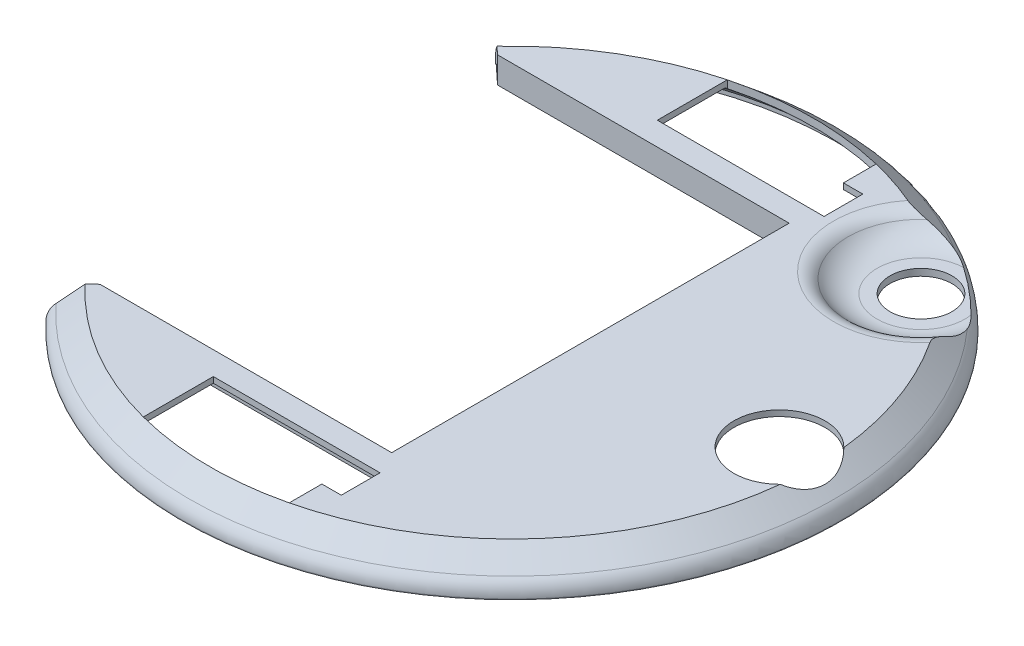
ISO-10303-21;
HEADER;
FILE_DESCRIPTION(('STEP AP214'),'2;1');
FILE_NAME('part.step','',(''),(''),'','','');
FILE_SCHEMA(('AUTOMOTIVE_DESIGN { 1 0 10303 214 1 1 1 1 }'));
ENDSEC;
DATA;
#1=APPLICATION_CONTEXT('core data for automotive mechanical design processes');
#2=APPLICATION_PROTOCOL_DEFINITION('international standard','automotive_design',2000,#1);
#3=PRODUCT_CONTEXT('',#1,'mechanical');
#4=PRODUCT('Part','Part','',(#3));
#5=PRODUCT_RELATED_PRODUCT_CATEGORY('part','',(#4));
#6=PRODUCT_DEFINITION_FORMATION('','',#4);
#7=PRODUCT_DEFINITION_CONTEXT('part definition',#1,'design');
#8=PRODUCT_DEFINITION('design','',#6,#7);
#9=PRODUCT_DEFINITION_SHAPE('','',#8);
#10=(LENGTH_UNIT() NAMED_UNIT(*) SI_UNIT(.MILLI.,.METRE.));
#11=(NAMED_UNIT(*) PLANE_ANGLE_UNIT() SI_UNIT($,.RADIAN.));
#12=(NAMED_UNIT(*) SI_UNIT($,.STERADIAN.) SOLID_ANGLE_UNIT());
#13=UNCERTAINTY_MEASURE_WITH_UNIT(LENGTH_MEASURE(1.E-05),#10,'distance_accuracy_value','');
#14=(GEOMETRIC_REPRESENTATION_CONTEXT(3) GLOBAL_UNCERTAINTY_ASSIGNED_CONTEXT((#13)) GLOBAL_UNIT_ASSIGNED_CONTEXT((#10,
#11,#12)) REPRESENTATION_CONTEXT('',''));
#15=CARTESIAN_POINT('',(0.,0.,0.));
#16=DIRECTION('',(0.,0.,1.));
#17=DIRECTION('',(1.,0.,0.));
#18=AXIS2_PLACEMENT_3D('',#15,#16,#17);
#19=CARTESIAN_POINT('',(-170.,0.,0.));
#20=DIRECTION('',(0.,1.,0.));
#21=DIRECTION('',(0.,0.,1.));
#22=AXIS2_PLACEMENT_3D('',#19,#20,#21);
#23=PLANE('',#22);
#24=DIRECTION('',(0.731353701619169,0.,-0.6819983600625));
#25=VECTOR('',#24,1.);
#26=CARTESIAN_POINT('',(-109.91779277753,0.,102.5));
#27=LINE('',#26,#25);
#28=CARTESIAN_POINT('',(-124.330129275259,0.,115.939721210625));
#29=VERTEX_POINT('',#28);
#30=CARTESIAN_POINT('',(-122.86742187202,0.,114.5757244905));
#31=VERTEX_POINT('',#30);
#32=EDGE_CURVE('E364',#29,#31,#27,.T.);
#33=ORIENTED_EDGE('',*,*,#32,.T.);
#34=CARTESIAN_POINT('',(0.,0.,0.));
#35=DIRECTION('',(0.,1.,0.));
#36=DIRECTION('',(0.,0.,1.));
#37=AXIS2_PLACEMENT_3D('',#34,#35,#36);
#38=CIRCLE('',#37,168.);
#39=CARTESIAN_POINT('',(-122.86742187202,0.,-114.5757244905));
#40=VERTEX_POINT('',#39);
#41=EDGE_CURVE('E874',#31,#40,#38,.T.);
#42=ORIENTED_EDGE('',*,*,#41,.T.);
#43=DIRECTION('',(-0.731353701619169,0.,-0.6819983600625));
#44=VECTOR('',#43,1.);
#45=CARTESIAN_POINT('',(-109.91779277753,0.,-102.5));
#46=LINE('',#45,#44);
#47=CARTESIAN_POINT('',(-124.330129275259,0.,-115.939721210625));
#48=VERTEX_POINT('',#47);
#49=EDGE_CURVE('E371',#40,#48,#46,.T.);
#50=ORIENTED_EDGE('',*,*,#49,.T.);
#51=CARTESIAN_POINT('',(0.,0.,0.));
#52=DIRECTION('',(0.,-1.,0.));
#53=DIRECTION('',(0.,0.,-1.));
#54=AXIS2_PLACEMENT_3D('',#51,#52,#53);
#55=CIRCLE('',#54,170.);
#56=EDGE_CURVE('E322',#48,#29,#55,.T.);
#57=ORIENTED_EDGE('',*,*,#56,.T.);
#58=EDGE_LOOP('',(#33,#42,#50,#57));
#59=FACE_BOUND('',#58,.T.);
#60=ADVANCED_FACE('F31',(#59),#23,.F.);
#61=CARTESIAN_POINT('',(0.,17.,0.));
#62=DIRECTION('',(0.,-1.,0.));
#63=DIRECTION('',(0.,0.,-1.));
#64=AXIS2_PLACEMENT_3D('',#61,#62,#63);
#65=CONICAL_SURFACE('',#64,155.698956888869,0.872664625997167);
#66=CARTESIAN_POINT('',(0.,17.,0.));
#67=DIRECTION('',(0.,-1.,0.));
#68=DIRECTION('',(0.,0.,-1.));
#69=AXIS2_PLACEMENT_3D('',#66,#67,#68);
#70=CIRCLE('',#69,155.698956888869);
#71=CARTESIAN_POINT('',(-113.871008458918,17.,-106.186433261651));
#72=VERTEX_POINT('',#71);
#73=CARTESIAN_POINT('',(-39.5,17.,-150.605163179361));
#74=VERTEX_POINT('',#73);
#75=EDGE_CURVE('E324',#72,#74,#70,.T.);
#76=ORIENTED_EDGE('',*,*,#75,.T.);
#77=CARTESIAN_POINT('',(0.,17.,0.));
#78=DIRECTION('',(0.,1.,0.));
#79=DIRECTION('',(0.,0.,-1.));
#80=AXIS2_PLACEMENT_3D('',#77,#78,#79);
#81=CIRCLE('',#80,155.698956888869);
#82=CARTESIAN_POINT('',(36.5,17.,-151.360216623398));
#83=VERTEX_POINT('',#82);
#84=EDGE_CURVE('E307',#83,#74,#81,.T.);
#85=ORIENTED_EDGE('',*,*,#84,.F.);
#86=CARTESIAN_POINT('',(60.9422442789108,17.,-143.276683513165));
#87=VERTEX_POINT('',#86);
#88=EDGE_CURVE('E329',#83,#87,#70,.T.);
#89=ORIENTED_EDGE('',*,*,#88,.T.);
#90=CARTESIAN_POINT('',(60.9422442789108,17.,-143.276683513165));
#91=CARTESIAN_POINT('',(61.0722909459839,17.000002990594,-143.221365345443));
#92=CARTESIAN_POINT('',(61.2035167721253,16.9972270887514,-143.168934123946));
#93=CARTESIAN_POINT('',(61.4678171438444,16.9863767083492,-143.069732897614));
#94=CARTESIAN_POINT('',(61.600890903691,16.978304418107,-143.022960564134));
#95=CARTESIAN_POINT('',(62.00140785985,16.9465971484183,-142.8911861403));
#96=CARTESIAN_POINT('',(62.2710030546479,16.9154683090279,-142.814366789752));
#97=CARTESIAN_POINT('',(62.8076815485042,16.8362482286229,-142.682308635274));
#98=CARTESIAN_POINT('',(63.0747258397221,16.7884644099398,-142.626714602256));
#99=CARTESIAN_POINT('',(63.6090353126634,16.6780450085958,-142.533339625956));
#100=CARTESIAN_POINT('',(63.8763004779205,16.6153961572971,-142.495574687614));
#101=CARTESIAN_POINT('',(64.5275153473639,16.4467371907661,-142.42280921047));
#102=CARTESIAN_POINT('',(64.9106383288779,16.3338196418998,-142.396464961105));
#103=CARTESIAN_POINT('',(65.6708328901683,16.0869049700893,-142.37160007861));
#104=CARTESIAN_POINT('',(66.0479020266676,15.952899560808,-142.373090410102));
#105=CARTESIAN_POINT('',(66.7985696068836,15.6667175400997,-142.399255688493));
#106=CARTESIAN_POINT('',(67.1720929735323,15.5143689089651,-142.424167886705));
#107=CARTESIAN_POINT('',(67.9112923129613,15.1961591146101,-142.493394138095));
#108=CARTESIAN_POINT('',(68.2769699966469,15.0303009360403,-142.537703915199));
#109=CARTESIAN_POINT('',(69.0376248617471,14.6703155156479,-142.647677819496));
#110=CARTESIAN_POINT('',(69.4318009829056,14.4750286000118,-142.715055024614));
#111=CARTESIAN_POINT('',(70.0141452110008,14.1756027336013,-142.827517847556));
#112=CARTESIAN_POINT('',(70.2055448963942,14.0753904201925,-142.866611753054));
#113=CARTESIAN_POINT('',(70.5863763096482,13.8726809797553,-142.948314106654));
#114=CARTESIAN_POINT('',(70.7758080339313,13.7701838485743,-142.990922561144));
#115=CARTESIAN_POINT('',(70.9643121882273,13.6666666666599,-143.035115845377));
#116=B_SPLINE_CURVE_WITH_KNOTS('',3,(#90,#91,#92,#93,#94,#95,#96,#97,#98,#99,#100,#101,#102,
#103,#104,#105,#106,#107,#108,#109,#110,#111,#112,#113,#114,#115),.UNSPECIFIED.,.F.,.F.,(4,2,2,
2,2,2,2,2,2,2,2,2,4),(0.,0.423830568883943,0.847486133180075,1.69202595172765,2.52173734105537,
3.35219214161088,4.55100419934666,5.75028850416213,6.96185333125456,8.17315121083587,
9.50760193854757,10.1662317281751,10.824862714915),.UNSPECIFIED.);
#117=CARTESIAN_POINT('',(70.9643121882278,13.6666666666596,-143.035115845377));
#118=VERTEX_POINT('',#117);
#119=EDGE_CURVE('E647',#87,#118,#116,.T.);
#120=ORIENTED_EDGE('',*,*,#119,.T.);
#121=CARTESIAN_POINT('',(65.7276536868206,17.,-141.14545942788));
#122=CARTESIAN_POINT('',(66.0444468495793,16.7659981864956,-141.305563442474));
#123=CARTESIAN_POINT('',(66.366780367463,16.5348847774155,-141.458779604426));
#124=CARTESIAN_POINT('',(67.0219642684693,16.0787224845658,-141.751108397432));
#125=CARTESIAN_POINT('',(67.3548146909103,15.8536736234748,-141.890220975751));
#126=CARTESIAN_POINT('',(68.3681959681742,15.1881210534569,-142.285872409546));
#127=CARTESIAN_POINT('',(69.0636471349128,14.7571447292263,-142.520770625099));
#128=CARTESIAN_POINT('',(70.4891474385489,13.9230356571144,-142.930354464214));
#129=CARTESIAN_POINT('',(71.2192345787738,13.5199347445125,-143.104972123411));
#130=CARTESIAN_POINT('',(72.7074552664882,12.7444985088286,-143.391524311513));
#131=CARTESIAN_POINT('',(73.465585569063,12.372159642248,-143.503466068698));
#132=CARTESIAN_POINT('',(74.9727441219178,11.6748410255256,-143.65977363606));
#133=CARTESIAN_POINT('',(75.7209069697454,11.3485571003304,-143.706682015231));
#134=CARTESIAN_POINT('',(77.2319129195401,10.728168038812,-143.74016802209));
#135=CARTESIAN_POINT('',(77.9947577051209,10.4340666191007,-143.726738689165));
#136=CARTESIAN_POINT('',(79.5274177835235,9.88041057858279,-143.639040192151));
#137=CARTESIAN_POINT('',(80.2972128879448,9.62077767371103,-143.564911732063));
#138=CARTESIAN_POINT('',(81.8393125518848,9.1368249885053,-143.355950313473));
#139=CARTESIAN_POINT('',(82.6116156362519,8.91248731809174,-143.221148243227));
#140=CARTESIAN_POINT('',(83.8822088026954,8.57265793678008,-142.949333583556));
#141=CARTESIAN_POINT('',(84.381485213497,8.44660785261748,-142.82972042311));
#142=CARTESIAN_POINT('',(85.3765605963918,8.21021186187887,-142.565630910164));
#143=CARTESIAN_POINT('',(85.8723627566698,8.09984904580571,-142.421181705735));
#144=CARTESIAN_POINT('',(86.3659509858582,7.99736784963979,-142.264403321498));
#145=B_SPLINE_CURVE_WITH_KNOTS('',3,(#121,#122,#123,#124,#125,#126,#127,#128,#129,#130,#131,
#132,#133,#134,#135,#136,#137,#138,#139,#140,#141,#142,#143,#144),.UNSPECIFIED.,.F.,.F.,(4,2,2,
2,2,2,2,2,2,2,2,4),(0.,1.27522161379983,2.55044799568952,5.10053855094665,7.65349493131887,
10.2061568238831,12.6559001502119,15.1059260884,17.5502887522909,19.9934084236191,
21.5785949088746,23.162059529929),.UNSPECIFIED.);
#146=CARTESIAN_POINT('',(86.3659509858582,7.99736784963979,-142.264403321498));
#147=VERTEX_POINT('',#146);
#148=EDGE_CURVE('E640',#118,#147,#145,.T.);
#149=ORIENTED_EDGE('',*,*,#148,.T.);
#150=CARTESIAN_POINT('',(0.,7.99736784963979,0.));
#151=DIRECTION('',(0.,-1.,0.));
#152=DIRECTION('',(0.,0.,-1.));
#153=AXIS2_PLACEMENT_3D('',#150,#151,#152);
#154=CIRCLE('',#153,166.427876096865);
#155=CARTESIAN_POINT('',(-121.717643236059,7.99736784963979,-113.503538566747));
#156=VERTEX_POINT('',#155);
#157=EDGE_CURVE('E336',#156,#147,#154,.T.);
#158=ORIENTED_EDGE('',*,*,#157,.F.);
#159=DIRECTION('',(0.560249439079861,0.642787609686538,0.522441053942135));
#160=VECTOR('',#159,1.);
#161=CARTESIAN_POINT('',(0.,147.646937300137,0.));
#162=LINE('',#161,#160);
#163=EDGE_CURVE('E358',#156,#72,#162,.T.);
#164=ORIENTED_EDGE('',*,*,#163,.T.);
#165=EDGE_LOOP('',(#76,#85,#89,#120,#149,#158,#164));
#166=FACE_BOUND('',#165,.T.);
#167=ADVANCED_FACE('F613',(#166),#65,.T.);
#168=CARTESIAN_POINT('',(0.,-23.4118667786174,0.));
#169=DIRECTION('',(0.,-1.,0.));
#170=DIRECTION('',(0.,0.,-1.));
#171=AXIS2_PLACEMENT_3D('',#168,#169,#170);
#172=CYLINDRICAL_SURFACE('',#171,170.);
#173=CARTESIAN_POINT('',(0.,0.33692341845,0.));
#174=DIRECTION('',(0.,-1.,0.));
#175=DIRECTION('',(0.,0.,-1.));
#176=AXIS2_PLACEMENT_3D('',#173,#174,#175);
#177=CIRCLE('',#176,170.);
#178=CARTESIAN_POINT('',(-124.330129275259,0.33692341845,-115.939721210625));
#179=VERTEX_POINT('',#178);
#180=CARTESIAN_POINT('',(-124.330129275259,0.33692341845,115.939721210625));
#181=VERTEX_POINT('',#180);
#182=EDGE_CURVE('E345',#179,#181,#177,.T.);
#183=ORIENTED_EDGE('',*,*,#182,.T.);
#184=DIRECTION('',(0.,-1.,0.));
#185=VECTOR('',#184,1.);
#186=CARTESIAN_POINT('',(-124.330129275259,-23.4118667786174,115.939721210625));
#187=LINE('',#186,#185);
#188=EDGE_CURVE('E349',#181,#29,#187,.T.);
#189=ORIENTED_EDGE('',*,*,#188,.T.);
#190=ORIENTED_EDGE('',*,*,#56,.F.);
#191=DIRECTION('',(0.,-1.,0.));
#192=VECTOR('',#191,1.);
#193=CARTESIAN_POINT('',(-124.330129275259,-23.4118667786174,-115.939721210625));
#194=LINE('',#193,#192);
#195=EDGE_CURVE('E355',#48,#179,#194,.F.);
#196=ORIENTED_EDGE('',*,*,#195,.T.);
#197=EDGE_LOOP('',(#183,#189,#190,#196));
#198=FACE_BOUND('',#197,.T.);
#199=ADVANCED_FACE('F33',(#198),#172,.T.);
#200=CARTESIAN_POINT('',(-155.698956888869,17.,0.));
#201=DIRECTION('',(0.,-1.,0.));
#202=DIRECTION('',(0.,0.,-1.));
#203=AXIS2_PLACEMENT_3D('',#200,#201,#202);
#204=PLANE('',#203);
#205=CARTESIAN_POINT('',(154.833026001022,17.,16.3981473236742));
#206=VERTEX_POINT('',#205);
#207=CARTESIAN_POINT('',(36.5,17.,151.360216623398));
#208=VERTEX_POINT('',#207);
#209=EDGE_CURVE('E316',#206,#208,#70,.T.);
#210=ORIENTED_EDGE('',*,*,#209,.F.);
#211=CARTESIAN_POINT('',(138.,17.,0.));
#212=DIRECTION('',(0.,1.,0.));
#213=DIRECTION('',(0.,0.,1.));
#214=AXIS2_PLACEMENT_3D('',#211,#212,#213);
#215=CIRCLE('',#214,23.5);
#216=CARTESIAN_POINT('',(154.833026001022,17.,-16.3981473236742));
#217=VERTEX_POINT('',#216);
#218=EDGE_CURVE('E45',#217,#206,#215,.T.);
#219=ORIENTED_EDGE('',*,*,#218,.F.);
#220=CARTESIAN_POINT('',(130.084742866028,17.,-85.557728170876));
#221=VERTEX_POINT('',#220);
#222=EDGE_CURVE('E313',#221,#217,#70,.T.);
#223=ORIENTED_EDGE('',*,*,#222,.F.);
#224=CARTESIAN_POINT('',(96.,17.,-115.));
#225=DIRECTION('',(0.,-1.,0.));
#226=DIRECTION('',(0.,0.,-1.));
#227=AXIS2_PLACEMENT_3D('',#224,#225,#226);
#228=CIRCLE('',#227,45.0401716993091);
#229=EDGE_CURVE('E685',#221,#87,#228,.T.);
#230=ORIENTED_EDGE('',*,*,#229,.T.);
#231=ORIENTED_EDGE('',*,*,#88,.F.);
#232=DIRECTION('',(0.,0.,-1.));
#233=VECTOR('',#232,1.);
#234=CARTESIAN_POINT('',(36.5,17.,-134.5));
#235=LINE('',#234,#233);
#236=CARTESIAN_POINT('',(36.5,17.,-134.5));
#237=VERTEX_POINT('',#236);
#238=EDGE_CURVE('E720',#237,#83,#235,.T.);
#239=ORIENTED_EDGE('',*,*,#238,.F.);
#240=DIRECTION('',(-1.,0.,0.));
#241=VECTOR('',#240,1.);
#242=CARTESIAN_POINT('',(46.5,17.,-134.5));
#243=LINE('',#242,#241);
#244=CARTESIAN_POINT('',(46.5,17.,-134.5));
#245=VERTEX_POINT('',#244);
#246=EDGE_CURVE('E717',#245,#237,#243,.T.);
#247=ORIENTED_EDGE('',*,*,#246,.F.);
#248=DIRECTION('',(0.,0.,-1.));
#249=VECTOR('',#248,1.);
#250=CARTESIAN_POINT('',(46.5,17.,-114.5));
#251=LINE('',#250,#249);
#252=CARTESIAN_POINT('',(46.5,17.,-114.5));
#253=VERTEX_POINT('',#252);
#254=EDGE_CURVE('E711',#253,#245,#251,.T.);
#255=ORIENTED_EDGE('',*,*,#254,.F.);
#256=DIRECTION('',(1.,0.,0.));
#257=VECTOR('',#256,1.);
#258=CARTESIAN_POINT('',(46.5,17.,-114.5));
#259=LINE('',#258,#257);
#260=CARTESIAN_POINT('',(-39.5,17.,-114.5));
#261=VERTEX_POINT('',#260);
#262=EDGE_CURVE('E708',#261,#253,#259,.T.);
#263=ORIENTED_EDGE('',*,*,#262,.F.);
#264=DIRECTION('',(0.,0.,1.));
#265=VECTOR('',#264,1.);
#266=CARTESIAN_POINT('',(-39.5,17.,-114.5));
#267=LINE('',#266,#265);
#268=EDGE_CURVE('E705',#74,#261,#267,.T.);
#269=ORIENTED_EDGE('',*,*,#268,.F.);
#270=ORIENTED_EDGE('',*,*,#75,.F.);
#271=DIRECTION('',(-0.731353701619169,0.,-0.6819983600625));
#272=VECTOR('',#271,1.);
#273=CARTESIAN_POINT('',(-109.91779277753,17.,-102.5));
#274=LINE('',#273,#272);
#275=CARTESIAN_POINT('',(-109.91779277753,17.,-102.5));
#276=VERTEX_POINT('',#275);
#277=EDGE_CURVE('E382',#276,#72,#274,.T.);
#278=ORIENTED_EDGE('',*,*,#277,.F.);
#279=DIRECTION('',(-1.,0.,0.));
#280=VECTOR('',#279,1.);
#281=CARTESIAN_POINT('',(40.5,17.,-102.5));
#282=LINE('',#281,#280);
#283=CARTESIAN_POINT('',(40.5,17.,-102.5));
#284=VERTEX_POINT('',#283);
#285=EDGE_CURVE('E384',#284,#276,#282,.T.);
#286=ORIENTED_EDGE('',*,*,#285,.F.);
#287=DIRECTION('',(0.,0.,-1.));
#288=VECTOR('',#287,1.);
#289=CARTESIAN_POINT('',(40.5,17.,102.5));
#290=LINE('',#289,#288);
#291=CARTESIAN_POINT('',(40.5,17.,102.5));
#292=VERTEX_POINT('',#291);
#293=EDGE_CURVE('E373',#292,#284,#290,.T.);
#294=ORIENTED_EDGE('',*,*,#293,.F.);
#295=DIRECTION('',(1.,0.,0.));
#296=VECTOR('',#295,1.);
#297=CARTESIAN_POINT('',(40.5,17.,102.5));
#298=LINE('',#297,#296);
#299=CARTESIAN_POINT('',(-109.91779277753,17.,102.5));
#300=VERTEX_POINT('',#299);
#301=EDGE_CURVE('E376',#300,#292,#298,.T.);
#302=ORIENTED_EDGE('',*,*,#301,.F.);
#303=DIRECTION('',(0.731353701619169,0.,-0.6819983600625));
#304=VECTOR('',#303,1.);
#305=CARTESIAN_POINT('',(-109.91779277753,17.,102.5));
#306=LINE('',#305,#304);
#307=CARTESIAN_POINT('',(-113.871008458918,17.,106.186433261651));
#308=VERTEX_POINT('',#307);
#309=EDGE_CURVE('E379',#308,#300,#306,.T.);
#310=ORIENTED_EDGE('',*,*,#309,.F.);
#311=CARTESIAN_POINT('',(-39.5,17.,150.605163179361));
#312=VERTEX_POINT('',#311);
#313=EDGE_CURVE('E328',#312,#308,#70,.T.);
#314=ORIENTED_EDGE('',*,*,#313,.F.);
#315=DIRECTION('',(0.,0.,1.));
#316=VECTOR('',#315,1.);
#317=CARTESIAN_POINT('',(-39.5,17.,114.5));
#318=LINE('',#317,#316);
#319=CARTESIAN_POINT('',(-39.5,17.,114.5));
#320=VERTEX_POINT('',#319);
#321=EDGE_CURVE('E910',#320,#312,#318,.T.);
#322=ORIENTED_EDGE('',*,*,#321,.F.);
#323=DIRECTION('',(-1.,0.,0.));
#324=VECTOR('',#323,1.);
#325=CARTESIAN_POINT('',(46.5,17.,114.5));
#326=LINE('',#325,#324);
#327=CARTESIAN_POINT('',(46.5,17.,114.5));
#328=VERTEX_POINT('',#327);
#329=EDGE_CURVE('E913',#328,#320,#326,.T.);
#330=ORIENTED_EDGE('',*,*,#329,.F.);
#331=DIRECTION('',(0.,0.,-1.));
#332=VECTOR('',#331,1.);
#333=CARTESIAN_POINT('',(46.5,17.,114.5));
#334=LINE('',#333,#332);
#335=CARTESIAN_POINT('',(46.5,17.,134.5));
#336=VERTEX_POINT('',#335);
#337=EDGE_CURVE('E545',#336,#328,#334,.T.);
#338=ORIENTED_EDGE('',*,*,#337,.F.);
#339=DIRECTION('',(1.,0.,0.));
#340=VECTOR('',#339,1.);
#341=CARTESIAN_POINT('',(46.5,17.,134.5));
#342=LINE('',#341,#340);
#343=CARTESIAN_POINT('',(36.5,17.,134.5));
#344=VERTEX_POINT('',#343);
#345=EDGE_CURVE('E892',#344,#336,#342,.T.);
#346=ORIENTED_EDGE('',*,*,#345,.F.);
#347=DIRECTION('',(0.,0.,-1.));
#348=VECTOR('',#347,1.);
#349=CARTESIAN_POINT('',(36.5,17.,134.5));
#350=LINE('',#349,#348);
#351=EDGE_CURVE('E903',#208,#344,#350,.T.);
#352=ORIENTED_EDGE('',*,*,#351,.F.);
#353=EDGE_LOOP('',(#210,#219,#223,#230,#231,#239,#247,#255,#263,#269,#270,#278,#286,#294,#302,
#310,#314,#322,#330,#338,#346,#352));
#354=FACE_BOUND('',#353,.T.);
#355=ADVANCED_FACE('F311',(#354),#204,.F.);
#356=ORIENTED_EDGE('',*,*,#222,.T.);
#357=CARTESIAN_POINT('',(154.83275708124,17.0002,-16.3984233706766));
#358=CARTESIAN_POINT('',(155.229140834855,16.7053977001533,-15.9915882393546));
#359=CARTESIAN_POINT('',(155.614267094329,16.4199758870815,-15.5666987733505));
#360=CARTESIAN_POINT('',(156.358614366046,15.869994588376,-14.6814714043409));
#361=CARTESIAN_POINT('',(156.717814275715,15.6054520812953,-14.2211052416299));
#362=CARTESIAN_POINT('',(157.408447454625,15.0982125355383,-13.2632208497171));
#363=CARTESIAN_POINT('',(157.739690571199,14.8556643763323,-12.7654858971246));
#364=CARTESIAN_POINT('',(158.367784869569,14.3968766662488,-11.7373795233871));
#365=CARTESIAN_POINT('',(158.664644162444,14.1806309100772,-11.2070158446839));
#366=CARTESIAN_POINT('',(159.221483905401,13.7758606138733,-10.1132159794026));
#367=CARTESIAN_POINT('',(159.48126514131,13.5874856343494,-9.54962255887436));
#368=CARTESIAN_POINT('',(159.958144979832,13.2422948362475,-8.39522763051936));
#369=CARTESIAN_POINT('',(160.175240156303,13.0854815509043,-7.80442394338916));
#370=CARTESIAN_POINT('',(160.562468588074,12.8061616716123,-6.60173515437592));
#371=CARTESIAN_POINT('',(160.732739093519,12.6835547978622,-5.98991770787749));
#372=CARTESIAN_POINT('',(161.024027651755,12.4740098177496,-4.74871800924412));
#373=CARTESIAN_POINT('',(161.14505293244,12.3870664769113,-4.11933834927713));
#374=CARTESIAN_POINT('',(161.325430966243,12.2575572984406,-2.91619467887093));
#375=CARTESIAN_POINT('',(161.389958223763,12.2112664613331,-2.3436007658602));
#376=CARTESIAN_POINT('',(161.476749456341,12.1490149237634,-1.19358897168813));
#377=CARTESIAN_POINT('',(161.499016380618,12.1330521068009,-0.616171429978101));
#378=CARTESIAN_POINT('',(161.500920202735,12.1316870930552,0.538962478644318));
#379=CARTESIAN_POINT('',(161.480542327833,12.1462954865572,1.11667887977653));
#380=CARTESIAN_POINT('',(161.397464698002,12.2058815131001,2.26746906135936));
#381=CARTESIAN_POINT('',(161.334766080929,12.250858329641,2.84054296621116));
#382=CARTESIAN_POINT('',(161.173674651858,12.3665135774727,3.9393105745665));
#383=CARTESIAN_POINT('',(161.077958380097,12.4352655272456,4.4656038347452));
#384=CARTESIAN_POINT('',(160.851909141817,12.5978040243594,5.50672134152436));
#385=CARTESIAN_POINT('',(160.721578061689,12.6915892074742,6.02154621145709));
#386=CARTESIAN_POINT('',(160.427990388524,12.9031302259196,7.03664925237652));
#387=CARTESIAN_POINT('',(160.264733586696,13.0208862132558,7.53692733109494));
#388=CARTESIAN_POINT('',(159.907284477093,13.2791170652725,8.52024614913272));
#389=CARTESIAN_POINT('',(159.713091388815,13.4195925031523,9.003286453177));
#390=CARTESIAN_POINT('',(159.285455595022,13.7294975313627,9.97368999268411));
#391=CARTESIAN_POINT('',(159.050529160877,13.9000287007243,10.4600467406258));
#392=CARTESIAN_POINT('',(158.551619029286,14.2629684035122,11.4091385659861));
#393=CARTESIAN_POINT('',(158.287632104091,14.4553793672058,11.8718710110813));
#394=CARTESIAN_POINT('',(157.733423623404,14.8602939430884,12.7718928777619));
#395=CARTESIAN_POINT('',(157.443209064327,15.0727921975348,13.2091890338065));
#396=CARTESIAN_POINT('',(156.839241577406,15.516184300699,14.0571633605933));
#397=CARTESIAN_POINT('',(156.525495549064,15.7470727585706,14.46784926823));
#398=CARTESIAN_POINT('',(155.982023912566,16.1481492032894,15.1333080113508));
#399=CARTESIAN_POINT('',(155.757977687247,16.3137915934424,15.3955157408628));
#400=CARTESIAN_POINT('',(155.301539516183,16.6519136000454,15.9067246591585));
#401=CARTESIAN_POINT('',(155.069166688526,16.8243776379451,16.1557532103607));
#402=CARTESIAN_POINT('',(154.83275708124,17.0002,16.3984233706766));
#403=B_SPLINE_CURVE_WITH_KNOTS('',3,(#357,#358,#359,#360,#361,#362,#363,#364,#365,#366,#367,
#368,#369,#370,#371,#372,#373,#374,#375,#376,#377,#378,#379,#380,#381,#382,#383,#384,#385,#386,
#387,#388,#389,#390,#391,#392,#393,#394,#395,#396,#397,#398,#399,#400,#401,#402),.UNSPECIFIED.,
.F.,.F.,(4,2,2,2,2,2,2,2,2,2,2,2,2,2,2,2,2,2,2,2,2,2,4),(0.,1.91972075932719,3.84098684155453,
5.77441436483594,7.70738486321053,9.65037861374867,11.5935282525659,13.5309200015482,
15.4680272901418,17.1999594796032,18.9317707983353,20.6641821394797,22.3965469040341,
24.0127027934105,25.6287706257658,27.2448487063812,28.8609675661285,30.5584427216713,
32.2561066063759,33.953318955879,35.6500356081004,36.7974972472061,37.9424746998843),.UNSPECIFIED.);
#404=EDGE_CURVE('E302',#217,#206,#403,.T.);
#405=ORIENTED_EDGE('',*,*,#404,.T.);
#406=ORIENTED_EDGE('',*,*,#209,.T.);
#407=CARTESIAN_POINT('',(0.,17.,0.));
#408=DIRECTION('',(0.,1.,0.));
#409=DIRECTION('',(0.,0.,1.));
#410=AXIS2_PLACEMENT_3D('',#407,#408,#409);
#411=CIRCLE('',#410,155.698956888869);
#412=EDGE_CURVE('E907',#312,#208,#411,.T.);
#413=ORIENTED_EDGE('',*,*,#412,.F.);
#414=ORIENTED_EDGE('',*,*,#313,.T.);
#415=DIRECTION('',(-0.560249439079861,-0.642787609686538,0.522441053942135));
#416=VECTOR('',#415,1.);
#417=CARTESIAN_POINT('',(0.,147.646937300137,0.));
#418=LINE('',#417,#416);
#419=CARTESIAN_POINT('',(-121.717643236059,7.99736784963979,113.503538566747));
#420=VERTEX_POINT('',#419);
#421=EDGE_CURVE('E352',#308,#420,#418,.T.);
#422=ORIENTED_EDGE('',*,*,#421,.T.);
#423=CARTESIAN_POINT('',(124.546897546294,7.99736784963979,-110.391613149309));
#424=VERTEX_POINT('',#423);
#425=EDGE_CURVE('E340',#424,#420,#154,.T.);
#426=ORIENTED_EDGE('',*,*,#425,.F.);
#427=CARTESIAN_POINT('',(124.546897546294,7.9973678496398,-110.391613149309));
#428=CARTESIAN_POINT('',(124.729909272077,8.07473823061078,-110.046124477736));
#429=CARTESIAN_POINT('',(124.906237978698,8.15659165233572,-109.698155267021));
#430=CARTESIAN_POINT('',(125.245287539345,8.32918925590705,-108.99782294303));
#431=CARTESIAN_POINT('',(125.408008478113,8.41993338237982,-108.645459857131));
#432=CARTESIAN_POINT('',(125.875303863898,8.70533151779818,-107.58284314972));
#433=CARTESIAN_POINT('',(126.159124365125,8.91319922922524,-106.866847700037));
#434=CARTESIAN_POINT('',(126.669448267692,9.36292068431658,-105.425612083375));
#435=CARTESIAN_POINT('',(126.89597267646,9.60476192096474,-104.700375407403));
#436=CARTESIAN_POINT('',(127.290791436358,10.1212118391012,-103.245732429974));
#437=CARTESIAN_POINT('',(127.459087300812,10.3958196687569,-102.516326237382));
#438=CARTESIAN_POINT('',(127.737080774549,10.9768123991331,-101.057529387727));
#439=CARTESIAN_POINT('',(127.846677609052,11.2832508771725,-100.328140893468));
#440=CARTESIAN_POINT('',(128.006708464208,11.9259002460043,-98.8759274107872));
#441=CARTESIAN_POINT('',(128.05713592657,12.2621144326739,-98.1531031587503));
#442=CARTESIAN_POINT('',(128.099068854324,12.9620506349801,-96.7202796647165));
#443=CARTESIAN_POINT('',(128.090646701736,13.3257383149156,-96.0102657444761));
#444=CARTESIAN_POINT('',(128.015739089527,14.078927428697,-94.6075276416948));
#445=CARTESIAN_POINT('',(127.949276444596,14.4684186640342,-93.9147967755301));
#446=CARTESIAN_POINT('',(127.774088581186,15.2089931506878,-92.6570994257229));
#447=CARTESIAN_POINT('',(127.673511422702,15.5566713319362,-92.0889731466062));
#448=CARTESIAN_POINT('',(127.432698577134,16.2671870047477,-90.9721702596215));
#449=CARTESIAN_POINT('',(127.292524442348,16.6300002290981,-90.4234649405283));
#450=CARTESIAN_POINT('',(127.132907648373,17.,-89.8854213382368));
#451=B_SPLINE_CURVE_WITH_KNOTS('',3,(#427,#428,#429,#430,#431,#432,#433,#434,#435,#436,#437,
#438,#439,#440,#441,#442,#443,#444,#445,#446,#447,#448,#449,#450),.UNSPECIFIED.,.F.,.F.,(4,2,2,
2,2,2,2,2,2,2,2,4),(0.,1.19546387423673,2.39092030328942,4.78109378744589,7.17038964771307,
9.55962340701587,11.9529459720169,14.3465337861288,16.7371781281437,19.126883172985,
21.1461612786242,23.1623175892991),.UNSPECIFIED.);
#452=CARTESIAN_POINT('',(128.056656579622,13.6666666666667,-95.3754196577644));
#453=VERTEX_POINT('',#452);
#454=EDGE_CURVE('E630',#424,#453,#451,.T.);
#455=ORIENTED_EDGE('',*,*,#454,.T.);
#456=CARTESIAN_POINT('',(128.056656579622,13.6666666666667,-95.3754196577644));
#457=CARTESIAN_POINT('',(128.045518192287,13.784298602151,-95.1556785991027));
#458=CARTESIAN_POINT('',(128.036597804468,13.9006283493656,-94.9351088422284));
#459=CARTESIAN_POINT('',(128.023739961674,14.1303181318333,-94.4922226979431));
#460=CARTESIAN_POINT('',(128.019803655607,14.2436774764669,-94.2699059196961));
#461=CARTESIAN_POINT('',(128.017461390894,14.4674995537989,-93.8225523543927));
#462=CARTESIAN_POINT('',(128.01907992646,14.577947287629,-93.5975078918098));
#463=CARTESIAN_POINT('',(128.028549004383,14.7949322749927,-93.1456803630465));
#464=CARTESIAN_POINT('',(128.036399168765,14.9014697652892,-92.9188974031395));
#465=CARTESIAN_POINT('',(128.059426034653,15.113487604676,-92.4561787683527));
#466=CARTESIAN_POINT('',(128.074833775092,15.2188196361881,-92.2201861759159));
#467=CARTESIAN_POINT('',(128.11396606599,15.4239810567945,-91.7465087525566));
#468=CARTESIAN_POINT('',(128.137690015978,15.5238108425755,-91.5088240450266));
#469=CARTESIAN_POINT('',(128.194415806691,15.7169491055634,-91.0323664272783));
#470=CARTESIAN_POINT('',(128.227401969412,15.8102682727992,-90.793596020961));
#471=CARTESIAN_POINT('',(128.303775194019,15.9895390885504,-90.3149800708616));
#472=CARTESIAN_POINT('',(128.34716039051,16.0754920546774,-90.0751347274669));
#473=CARTESIAN_POINT('',(128.447998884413,16.2429283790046,-89.5829397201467));
#474=CARTESIAN_POINT('',(128.506044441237,16.3239769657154,-89.330561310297));
#475=CARTESIAN_POINT('',(128.636458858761,16.4750947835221,-88.8260945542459));
#476=CARTESIAN_POINT('',(128.708831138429,16.545161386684,-88.5740062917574));
#477=CARTESIAN_POINT('',(128.868560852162,16.6717724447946,-88.0743038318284));
#478=CARTESIAN_POINT('',(128.955747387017,16.7284552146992,-87.8266707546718));
#479=CARTESIAN_POINT('',(129.147016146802,16.827291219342,-87.3350772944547));
#480=CARTESIAN_POINT('',(129.251092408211,16.8694495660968,-87.0911156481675));
#481=CARTESIAN_POINT('',(129.468222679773,16.9344533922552,-86.6287127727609));
#482=CARTESIAN_POINT('',(129.579874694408,16.9585827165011,-86.4098006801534));
#483=CARTESIAN_POINT('',(129.819781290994,16.9914291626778,-85.9780900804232));
#484=CARTESIAN_POINT('',(129.948146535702,17.0000373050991,-85.7653450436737));
#485=CARTESIAN_POINT('',(130.084742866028,17.,-85.557728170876));
#486=B_SPLINE_CURVE_WITH_KNOTS('',3,(#456,#457,#458,#459,#460,#461,#462,#463,#464,#465,#466,
#467,#468,#469,#470,#471,#472,#473,#474,#475,#476,#477,#478,#479,#480,#481,#482,#483,#484,#485),
.UNSPECIFIED.,.F.,.F.,(4,2,2,2,2,2,2,2,2,2,2,2,2,2,4),(0.,0.748493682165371,1.49715987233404,
2.24913155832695,3.00105763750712,3.7775557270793,4.55399776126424,5.32913336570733,
6.10413002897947,6.91766310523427,7.73139055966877,8.5362993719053,9.34092459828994,
10.0806260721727,10.8255013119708),.UNSPECIFIED.);
#487=EDGE_CURVE('E321',#453,#221,#486,.T.);
#488=ORIENTED_EDGE('',*,*,#487,.T.);
#489=EDGE_LOOP('',(#356,#405,#406,#413,#414,#422,#426,#455,#488));
#490=FACE_BOUND('',#489,.T.);
#491=ADVANCED_FACE('F318',(#490),#65,.T.);
#492=CARTESIAN_POINT('',(0.,0.336923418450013,0.));
#493=DIRECTION('',(0.,-1.,0.));
#494=DIRECTION('',(0.,0.,-1.));
#495=AXIS2_PLACEMENT_3D('',#492,#493,#494);
#496=TOROIDAL_SURFACE('',#495,160.,10.);
#497=ORIENTED_EDGE('',*,*,#157,.T.);
#498=CARTESIAN_POINT('',(86.3659509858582,7.9973678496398,-142.264403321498));
#499=CARTESIAN_POINT('',(86.7068673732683,7.92654851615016,-142.15610137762));
#500=CARTESIAN_POINT('',(87.0459145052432,7.85900040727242,-142.039933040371));
#501=CARTESIAN_POINT('',(87.7200067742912,7.73097025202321,-141.793236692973));
#502=CARTESIAN_POINT('',(88.0550528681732,7.67048648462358,-141.662712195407));
#503=CARTESIAN_POINT('',(88.7207231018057,7.55712857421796,-141.38875542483));
#504=CARTESIAN_POINT('',(89.0513512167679,7.50424710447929,-141.245335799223));
#505=CARTESIAN_POINT('',(89.7083883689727,7.40631382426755,-140.946621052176));
#506=CARTESIAN_POINT('',(90.0347971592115,7.36126247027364,-140.791325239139));
#507=CARTESIAN_POINT('',(90.6794056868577,7.27964449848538,-140.471795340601));
#508=CARTESIAN_POINT('',(90.9976568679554,7.24298363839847,-140.307689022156));
#509=CARTESIAN_POINT('',(91.6297840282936,7.17749686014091,-139.969757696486));
#510=CARTESIAN_POINT('',(91.9436595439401,7.14867176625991,-139.795931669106));
#511=CARTESIAN_POINT('',(92.878453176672,7.07388564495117,-139.261104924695));
#512=CARTESIAN_POINT('',(93.4927482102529,7.03958726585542,-138.886650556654));
#513=CARTESIAN_POINT('',(94.2016100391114,7.01663974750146,-138.429949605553));
#514=CARTESIAN_POINT('',(94.3055057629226,7.01370421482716,-138.362379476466));
#515=CARTESIAN_POINT('',(94.5127247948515,7.00868943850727,-138.226360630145));
#516=CARTESIAN_POINT('',(94.6160481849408,7.00661006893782,-138.157912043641));
#517=CARTESIAN_POINT('',(94.8223439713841,7.00329089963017,-138.020009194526));
#518=CARTESIAN_POINT('',(94.9253151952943,7.00205285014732,-137.950553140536));
#519=CARTESIAN_POINT('',(95.130703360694,7.00040728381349,-137.810785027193));
#520=CARTESIAN_POINT('',(95.2331202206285,6.99999988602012,-137.740472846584));
#521=CARTESIAN_POINT('',(95.335251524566,7.,-137.669747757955));
#522=B_SPLINE_CURVE_WITH_KNOTS('',3,(#498,#499,#500,#501,#502,#503,#504,#505,#506,#507,#508,
#509,#510,#511,#512,#513,#514,#515,#516,#517,#518,#519,#520,#521),.UNSPECIFIED.,.F.,.F.,(4,2,2,
2,2,2,2,2,2,2,2,4),(0.,1.09377435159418,2.18728167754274,3.27972796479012,4.37223791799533,
5.45179803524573,6.53147167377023,8.69011209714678,9.06202667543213,9.43388653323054,
9.80651764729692,10.1792021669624),.UNSPECIFIED.);
#523=CARTESIAN_POINT('',(95.3352515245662,7.,-137.669747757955));
#524=VERTEX_POINT('',#523);
#525=EDGE_CURVE('E674',#147,#524,#522,.T.);
#526=ORIENTED_EDGE('',*,*,#525,.T.);
#527=CARTESIAN_POINT('',(0.,7.,0.));
#528=DIRECTION('',(0.,-1.,0.));
#529=DIRECTION('',(0.,0.,-1.));
#530=AXIS2_PLACEMENT_3D('',#527,#528,#529);
#531=CIRCLE('',#530,167.456769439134);
#532=CARTESIAN_POINT('',(118.423822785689,7.,-118.395810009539));
#533=VERTEX_POINT('',#532);
#534=EDGE_CURVE('E387',#524,#533,#531,.T.);
#535=ORIENTED_EDGE('',*,*,#534,.T.);
#536=CARTESIAN_POINT('',(118.42382278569,7.,-118.395810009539));
#537=CARTESIAN_POINT('',(118.724468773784,6.99997096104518,-118.095072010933));
#538=CARTESIAN_POINT('',(119.020998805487,7.00477098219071,-117.790167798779));
#539=CARTESIAN_POINT('',(119.604912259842,7.02450968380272,-117.171943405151));
#540=CARTESIAN_POINT('',(119.892293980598,7.03945023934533,-116.858621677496));
#541=CARTESIAN_POINT('',(120.454687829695,7.07979335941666,-116.226060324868));
#542=CARTESIAN_POINT('',(120.729778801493,7.10511362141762,-115.906885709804));
#543=CARTESIAN_POINT('',(121.2688080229,7.16646444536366,-115.260255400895));
#544=CARTESIAN_POINT('',(121.53274654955,7.20249474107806,-114.932799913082));
#545=CARTESIAN_POINT('',(122.048779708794,7.2854434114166,-114.268782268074));
#546=CARTESIAN_POINT('',(122.300845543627,7.33238676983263,-113.932200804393));
#547=CARTESIAN_POINT('',(122.790947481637,7.43697534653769,-113.250622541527));
#548=CARTESIAN_POINT('',(123.028984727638,7.49461969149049,-112.905626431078));
#549=CARTESIAN_POINT('',(123.491121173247,7.6207306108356,-112.204362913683));
#550=CARTESIAN_POINT('',(123.715097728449,7.68927777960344,-111.848028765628));
#551=CARTESIAN_POINT('',(124.037554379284,7.79945839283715,-111.306922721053));
#552=CARTESIAN_POINT('',(124.142809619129,7.83742080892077,-111.125413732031));
#553=CARTESIAN_POINT('',(124.348523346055,7.91567673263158,-110.760179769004));
#554=CARTESIAN_POINT('',(124.448981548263,7.95597037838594,-110.576454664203));
#555=CARTESIAN_POINT('',(124.546897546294,7.99736784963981,-110.391613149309));
#556=B_SPLINE_CURVE_WITH_KNOTS('',3,(#536,#537,#538,#539,#540,#541,#542,#543,#544,#545,#546,
#547,#548,#549,#550,#551,#552,#553,#554,#555),.UNSPECIFIED.,.F.,.F.,(4,2,2,2,2,2,2,2,2,4),(0.,
1.27571418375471,2.55166432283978,3.81768712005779,5.08367844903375,6.35259712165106,
7.62141227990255,8.90008431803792,9.53969382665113,10.1793412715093),.UNSPECIFIED.);
#557=EDGE_CURVE('E678',#533,#424,#556,.T.);
#558=ORIENTED_EDGE('',*,*,#557,.T.);
#559=ORIENTED_EDGE('',*,*,#425,.T.);
#560=CARTESIAN_POINT('',(-117.016592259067,0.336923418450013,109.11973761));
#561=DIRECTION('',(0.6819983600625,0.,0.731353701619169));
#562=DIRECTION('',(0.731353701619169,0.,-0.6819983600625));
#563=AXIS2_PLACEMENT_3D('',#560,#561,#562);
#564=CIRCLE('',#563,10.);
#565=EDGE_CURVE('E689',#420,#181,#564,.T.);
#566=ORIENTED_EDGE('',*,*,#565,.T.);
#567=ORIENTED_EDGE('',*,*,#182,.F.);
#568=CARTESIAN_POINT('',(-117.016592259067,0.336923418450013,-109.11973761));
#569=DIRECTION('',(0.6819983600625,0.,-0.731353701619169));
#570=DIRECTION('',(-0.731353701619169,0.,-0.6819983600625));
#571=AXIS2_PLACEMENT_3D('',#568,#569,#570);
#572=CIRCLE('',#571,10.);
#573=EDGE_CURVE('E326',#179,#156,#572,.T.);
#574=ORIENTED_EDGE('',*,*,#573,.T.);
#575=EDGE_LOOP('',(#497,#526,#535,#558,#559,#566,#567,#574));
#576=FACE_BOUND('',#575,.T.);
#577=ADVANCED_FACE('F624',(#576),#496,.T.);
#578=CARTESIAN_POINT('',(96.,0.,-115.));
#579=DIRECTION('',(0.,1.,0.));
#580=DIRECTION('',(0.,0.,1.));
#581=AXIS2_PLACEMENT_3D('',#578,#579,#580);
#582=CYLINDRICAL_SURFACE('',#581,16.);
#583=CARTESIAN_POINT('',(96.,3.49999999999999,-115.));
#584=DIRECTION('',(0.,1.,0.));
#585=DIRECTION('',(0.,0.,1.));
#586=AXIS2_PLACEMENT_3D('',#583,#584,#585);
#587=CIRCLE('',#586,16.);
#588=CARTESIAN_POINT('',(96.,3.49999999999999,-99.));
#589=VERTEX_POINT('',#588);
#590=EDGE_CURVE('E848',#589,#589,#587,.F.);
#591=ORIENTED_EDGE('',*,*,#590,.T.);
#592=EDGE_LOOP('',(#591));
#593=FACE_BOUND('',#592,.T.);
#594=CARTESIAN_POINT('',(96.,7.,-115.));
#595=DIRECTION('',(0.,-1.,0.));
#596=DIRECTION('',(0.,0.,-1.));
#597=AXIS2_PLACEMENT_3D('',#594,#595,#596);
#598=CIRCLE('',#597,16.);
#599=CARTESIAN_POINT('',(96.,7.,-131.));
#600=VERTEX_POINT('',#599);
#601=EDGE_CURVE('E390',#600,#600,#598,.F.);
#602=ORIENTED_EDGE('',*,*,#601,.T.);
#603=EDGE_LOOP('',(#602));
#604=FACE_BOUND('',#603,.T.);
#605=ADVANCED_FACE('F1015',(#593,#604),#582,.F.);
#606=CARTESIAN_POINT('',(-109.91779277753,0.,102.5));
#607=DIRECTION('',(0.6819983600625,0.,0.731353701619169));
#608=DIRECTION('',(0.731353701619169,0.,-0.6819983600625));
#609=AXIS2_PLACEMENT_3D('',#606,#607,#608);
#610=PLANE('',#609);
#611=DIRECTION('',(-0.731353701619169,0.,0.6819983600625));
#612=VECTOR('',#611,1.);
#613=CARTESIAN_POINT('',(-109.91779277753,3.49999999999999,102.5));
#614=LINE('',#613,#612);
#615=CARTESIAN_POINT('',(-109.91779277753,3.49999999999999,102.5));
#616=VERTEX_POINT('',#615);
#617=CARTESIAN_POINT('',(-122.86742187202,3.49999999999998,114.5757244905));
#618=VERTEX_POINT('',#617);
#619=EDGE_CURVE('E851',#616,#618,#614,.T.);
#620=ORIENTED_EDGE('',*,*,#619,.T.);
#621=DIRECTION('',(0.,1.,0.));
#622=VECTOR('',#621,1.);
#623=CARTESIAN_POINT('',(-122.86742187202,45.9991312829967,114.5757244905));
#624=LINE('',#623,#622);
#625=EDGE_CURVE('E811',#618,#31,#624,.F.);
#626=ORIENTED_EDGE('',*,*,#625,.T.);
#627=ORIENTED_EDGE('',*,*,#32,.F.);
#628=ORIENTED_EDGE('',*,*,#188,.F.);
#629=ORIENTED_EDGE('',*,*,#565,.F.);
#630=ORIENTED_EDGE('',*,*,#421,.F.);
#631=ORIENTED_EDGE('',*,*,#309,.T.);
#632=DIRECTION('',(0.,1.,0.));
#633=VECTOR('',#632,1.);
#634=CARTESIAN_POINT('',(-109.91779277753,0.,102.5));
#635=LINE('',#634,#633);
#636=EDGE_CURVE('E363',#616,#300,#635,.T.);
#637=ORIENTED_EDGE('',*,*,#636,.F.);
#638=EDGE_LOOP('',(#620,#626,#627,#628,#629,#630,#631,#637));
#639=FACE_BOUND('',#638,.T.);
#640=ADVANCED_FACE('F1020',(#639),#610,.F.);
#641=CARTESIAN_POINT('',(-109.91779277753,0.,-102.5));
#642=DIRECTION('',(0.6819983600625,0.,-0.731353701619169));
#643=DIRECTION('',(-0.731353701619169,0.,-0.6819983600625));
#644=AXIS2_PLACEMENT_3D('',#641,#642,#643);
#645=PLANE('',#644);
#646=ORIENTED_EDGE('',*,*,#49,.F.);
#647=DIRECTION('',(0.,1.,0.));
#648=VECTOR('',#647,1.);
#649=CARTESIAN_POINT('',(-122.86742187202,45.9991312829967,-114.5757244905));
#650=LINE('',#649,#648);
#651=CARTESIAN_POINT('',(-122.86742187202,3.49999999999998,-114.5757244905));
#652=VERTEX_POINT('',#651);
#653=EDGE_CURVE('E766',#40,#652,#650,.T.);
#654=ORIENTED_EDGE('',*,*,#653,.T.);
#655=DIRECTION('',(0.731353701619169,0.,0.6819983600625));
#656=VECTOR('',#655,1.);
#657=CARTESIAN_POINT('',(-109.91779277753,3.49999999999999,-102.5));
#658=LINE('',#657,#656);
#659=CARTESIAN_POINT('',(-109.91779277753,3.49999999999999,-102.5));
#660=VERTEX_POINT('',#659);
#661=EDGE_CURVE('E854',#652,#660,#658,.T.);
#662=ORIENTED_EDGE('',*,*,#661,.T.);
#663=DIRECTION('',(0.,1.,0.));
#664=VECTOR('',#663,1.);
#665=CARTESIAN_POINT('',(-109.91779277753,0.,-102.5));
#666=LINE('',#665,#664);
#667=EDGE_CURVE('E361',#660,#276,#666,.T.);
#668=ORIENTED_EDGE('',*,*,#667,.T.);
#669=ORIENTED_EDGE('',*,*,#277,.T.);
#670=ORIENTED_EDGE('',*,*,#163,.F.);
#671=ORIENTED_EDGE('',*,*,#573,.F.);
#672=ORIENTED_EDGE('',*,*,#195,.F.);
#673=EDGE_LOOP('',(#646,#654,#662,#668,#669,#670,#671,#672));
#674=FACE_BOUND('',#673,.T.);
#675=ADVANCED_FACE('F1031',(#674),#645,.F.);
#676=CARTESIAN_POINT('',(40.5,0.,-102.5));
#677=DIRECTION('',(0.,0.,-1.));
#678=DIRECTION('',(-1.,0.,0.));
#679=AXIS2_PLACEMENT_3D('',#676,#677,#678);
#680=PLANE('',#679);
#681=ORIENTED_EDGE('',*,*,#667,.F.);
#682=DIRECTION('',(1.,0.,0.));
#683=VECTOR('',#682,1.);
#684=CARTESIAN_POINT('',(40.5,3.49999999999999,-102.5));
#685=LINE('',#684,#683);
#686=CARTESIAN_POINT('',(40.5,3.49999999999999,-102.5));
#687=VERTEX_POINT('',#686);
#688=EDGE_CURVE('E856',#660,#687,#685,.T.);
#689=ORIENTED_EDGE('',*,*,#688,.T.);
#690=DIRECTION('',(0.,1.,0.));
#691=VECTOR('',#690,1.);
#692=CARTESIAN_POINT('',(40.5,0.,-102.5));
#693=LINE('',#692,#691);
#694=EDGE_CURVE('E360',#687,#284,#693,.T.);
#695=ORIENTED_EDGE('',*,*,#694,.T.);
#696=ORIENTED_EDGE('',*,*,#285,.T.);
#697=EDGE_LOOP('',(#681,#689,#695,#696));
#698=FACE_BOUND('',#697,.T.);
#699=ADVANCED_FACE('F1041',(#698),#680,.F.);
#700=CARTESIAN_POINT('',(40.5,0.,102.5));
#701=DIRECTION('',(1.,0.,0.));
#702=DIRECTION('',(0.,0.,-1.));
#703=AXIS2_PLACEMENT_3D('',#700,#701,#702);
#704=PLANE('',#703);
#705=ORIENTED_EDGE('',*,*,#694,.F.);
#706=DIRECTION('',(0.,0.,1.));
#707=VECTOR('',#706,1.);
#708=CARTESIAN_POINT('',(40.5,3.49999999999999,102.5));
#709=LINE('',#708,#707);
#710=CARTESIAN_POINT('',(40.5,3.49999999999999,102.5));
#711=VERTEX_POINT('',#710);
#712=EDGE_CURVE('E859',#687,#711,#709,.T.);
#713=ORIENTED_EDGE('',*,*,#712,.T.);
#714=DIRECTION('',(0.,1.,0.));
#715=VECTOR('',#714,1.);
#716=CARTESIAN_POINT('',(40.5,0.,102.5));
#717=LINE('',#716,#715);
#718=EDGE_CURVE('E366',#711,#292,#717,.T.);
#719=ORIENTED_EDGE('',*,*,#718,.T.);
#720=ORIENTED_EDGE('',*,*,#293,.T.);
#721=EDGE_LOOP('',(#705,#713,#719,#720));
#722=FACE_BOUND('',#721,.T.);
#723=ADVANCED_FACE('F1050',(#722),#704,.F.);
#724=CARTESIAN_POINT('',(40.5,0.,102.5));
#725=DIRECTION('',(0.,0.,1.));
#726=DIRECTION('',(1.,0.,0.));
#727=AXIS2_PLACEMENT_3D('',#724,#725,#726);
#728=PLANE('',#727);
#729=ORIENTED_EDGE('',*,*,#718,.F.);
#730=DIRECTION('',(-1.,0.,0.));
#731=VECTOR('',#730,1.);
#732=CARTESIAN_POINT('',(40.5,3.49999999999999,102.5));
#733=LINE('',#732,#731);
#734=EDGE_CURVE('E862',#711,#616,#733,.T.);
#735=ORIENTED_EDGE('',*,*,#734,.T.);
#736=ORIENTED_EDGE('',*,*,#636,.T.);
#737=ORIENTED_EDGE('',*,*,#301,.T.);
#738=EDGE_LOOP('',(#729,#735,#736,#737));
#739=FACE_BOUND('',#738,.T.);
#740=ADVANCED_FACE('F1060',(#739),#728,.F.);
#741=CARTESIAN_POINT('',(96.,7.,-115.));
#742=DIRECTION('',(0.,-1.,0.));
#743=DIRECTION('',(0.,0.,-1.));
#744=AXIS2_PLACEMENT_3D('',#741,#742,#743);
#745=PLANE('',#744);
#746=ORIENTED_EDGE('',*,*,#601,.F.);
#747=EDGE_LOOP('',(#746));
#748=FACE_BOUND('',#747,.T.);
#749=ORIENTED_EDGE('',*,*,#534,.F.);
#750=CARTESIAN_POINT('',(96.,7.,-115.));
#751=DIRECTION('',(0.,-1.,0.));
#752=DIRECTION('',(0.,0.,-1.));
#753=AXIS2_PLACEMENT_3D('',#750,#751,#752);
#754=CIRCLE('',#753,22.6794919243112);
#755=EDGE_CURVE('E687',#524,#533,#754,.F.);
#756=ORIENTED_EDGE('',*,*,#755,.T.);
#757=EDGE_LOOP('',(#749,#756));
#758=FACE_BOUND('',#757,.T.);
#759=ADVANCED_FACE('F668',(#748,#758),#745,.F.);
#760=CARTESIAN_POINT('',(96.,27.,-115.));
#761=DIRECTION('',(0.,1.,0.));
#762=DIRECTION('',(0.,0.,1.));
#763=AXIS2_PLACEMENT_3D('',#760,#761,#762);
#764=TOROIDAL_SURFACE('',#763,22.6794919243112,20.);
#765=ORIENTED_EDGE('',*,*,#148,.F.);
#766=CARTESIAN_POINT('',(96.,13.6666666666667,-115.));
#767=DIRECTION('',(0.,1.,0.));
#768=DIRECTION('',(0.,0.,1.));
#769=AXIS2_PLACEMENT_3D('',#766,#767,#768);
#770=CIRCLE('',#769,37.5866117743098);
#771=EDGE_CURVE('E658',#118,#453,#770,.T.);
#772=ORIENTED_EDGE('',*,*,#771,.T.);
#773=ORIENTED_EDGE('',*,*,#454,.F.);
#774=ORIENTED_EDGE('',*,*,#557,.F.);
#775=ORIENTED_EDGE('',*,*,#755,.F.);
#776=ORIENTED_EDGE('',*,*,#525,.F.);
#777=EDGE_LOOP('',(#765,#772,#773,#774,#775,#776));
#778=FACE_BOUND('',#777,.T.);
#779=ADVANCED_FACE('F608',(#778),#764,.F.);
#780=CARTESIAN_POINT('',(96.,7.,-115.));
#781=DIRECTION('',(0.,-1.,0.));
#782=DIRECTION('',(0.,0.,-1.));
#783=AXIS2_PLACEMENT_3D('',#780,#781,#782);
#784=TOROIDAL_SURFACE('',#783,45.0401716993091,10.);
#785=ORIENTED_EDGE('',*,*,#487,.F.);
#786=ORIENTED_EDGE('',*,*,#771,.F.);
#787=ORIENTED_EDGE('',*,*,#119,.F.);
#788=ORIENTED_EDGE('',*,*,#229,.F.);
#789=EDGE_LOOP('',(#785,#786,#787,#788));
#790=FACE_BOUND('',#789,.T.);
#791=ADVANCED_FACE('F603',(#790),#784,.T.);
#792=CARTESIAN_POINT('',(0.,45.9991312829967,0.));
#793=DIRECTION('',(0.,1.,0.));
#794=DIRECTION('',(0.,0.,1.));
#795=AXIS2_PLACEMENT_3D('',#792,#793,#794);
#796=CYLINDRICAL_SURFACE('',#795,168.);
#797=CARTESIAN_POINT('',(0.,3.49999999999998,0.));
#798=DIRECTION('',(0.,1.,0.));
#799=DIRECTION('',(0.,0.,1.));
#800=AXIS2_PLACEMENT_3D('',#797,#798,#799);
#801=CIRCLE('',#800,168.);
#802=EDGE_CURVE('E876',#618,#652,#801,.T.);
#803=ORIENTED_EDGE('',*,*,#802,.T.);
#804=ORIENTED_EDGE('',*,*,#653,.F.);
#805=ORIENTED_EDGE('',*,*,#41,.F.);
#806=ORIENTED_EDGE('',*,*,#625,.F.);
#807=EDGE_LOOP('',(#803,#804,#805,#806));
#808=FACE_BOUND('',#807,.T.);
#809=ADVANCED_FACE('F600',(#808),#796,.F.);
#810=CARTESIAN_POINT('',(0.,3.49999999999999,0.));
#811=DIRECTION('',(0.,1.,0.));
#812=DIRECTION('',(0.,0.,1.));
#813=AXIS2_PLACEMENT_3D('',#810,#811,#812);
#814=PLANE('',#813);
#815=ORIENTED_EDGE('',*,*,#734,.F.);
#816=ORIENTED_EDGE('',*,*,#712,.F.);
#817=ORIENTED_EDGE('',*,*,#688,.F.);
#818=ORIENTED_EDGE('',*,*,#661,.F.);
#819=ORIENTED_EDGE('',*,*,#802,.F.);
#820=ORIENTED_EDGE('',*,*,#619,.F.);
#821=EDGE_LOOP('',(#815,#816,#817,#818,#819,#820));
#822=FACE_BOUND('',#821,.T.);
#823=CARTESIAN_POINT('',(96.,3.49999999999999,-115.));
#824=DIRECTION('',(0.,1.,0.));
#825=DIRECTION('',(0.,0.,1.));
#826=AXIS2_PLACEMENT_3D('',#823,#824,#825);
#827=CIRCLE('',#826,19.);
#828=CARTESIAN_POINT('',(114.039851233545,3.49999999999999,-120.963536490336));
#829=VERTEX_POINT('',#828);
#830=CARTESIAN_POINT('',(98.6448519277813,3.49999999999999,-133.815014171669));
#831=VERTEX_POINT('',#830);
#832=EDGE_CURVE('E865',#829,#831,#827,.F.);
#833=ORIENTED_EDGE('',*,*,#832,.T.);
#834=CARTESIAN_POINT('',(0.,3.49999999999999,0.));
#835=DIRECTION('',(0.,1.,0.));
#836=DIRECTION('',(0.,0.,1.));
#837=AXIS2_PLACEMENT_3D('',#834,#835,#836);
#838=CIRCLE('',#837,166.244593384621);
#839=CARTESIAN_POINT('',(-119.517805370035,3.49999999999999,-115.554138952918));
#840=VERTEX_POINT('',#839);
#841=EDGE_CURVE('E787',#831,#840,#838,.T.);
#842=ORIENTED_EDGE('',*,*,#841,.T.);
#843=DIRECTION('',(0.731353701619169,0.,0.6819983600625));
#844=VECTOR('',#843,1.);
#845=CARTESIAN_POINT('',(-107.871797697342,3.49999999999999,-104.694061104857));
#846=LINE('',#845,#844);
#847=CARTESIAN_POINT('',(-108.736061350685,3.49999999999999,-105.5));
#848=VERTEX_POINT('',#847);
#849=EDGE_CURVE('E788',#840,#848,#846,.T.);
#850=ORIENTED_EDGE('',*,*,#849,.T.);
#851=DIRECTION('',(1.,0.,0.));
#852=VECTOR('',#851,1.);
#853=CARTESIAN_POINT('',(40.5,3.49999999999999,-105.5));
#854=LINE('',#853,#852);
#855=CARTESIAN_POINT('',(43.5,3.49999999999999,-105.5));
#856=VERTEX_POINT('',#855);
#857=EDGE_CURVE('E871',#848,#856,#854,.T.);
#858=ORIENTED_EDGE('',*,*,#857,.T.);
#859=DIRECTION('',(0.,0.,1.));
#860=VECTOR('',#859,1.);
#861=CARTESIAN_POINT('',(43.5,3.49999999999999,102.5));
#862=LINE('',#861,#860);
#863=CARTESIAN_POINT('',(43.5,3.49999999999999,105.5));
#864=VERTEX_POINT('',#863);
#865=EDGE_CURVE('E777',#856,#864,#862,.T.);
#866=ORIENTED_EDGE('',*,*,#865,.T.);
#867=DIRECTION('',(-1.,0.,0.));
#868=VECTOR('',#867,1.);
#869=CARTESIAN_POINT('',(40.5,3.49999999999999,105.5));
#870=LINE('',#869,#868);
#871=CARTESIAN_POINT('',(-108.736061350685,3.49999999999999,105.5));
#872=VERTEX_POINT('',#871);
#873=EDGE_CURVE('E657',#864,#872,#870,.T.);
#874=ORIENTED_EDGE('',*,*,#873,.T.);
#875=DIRECTION('',(-0.731353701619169,0.,0.6819983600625));
#876=VECTOR('',#875,1.);
#877=CARTESIAN_POINT('',(-107.871797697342,3.49999999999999,104.694061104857));
#878=LINE('',#877,#876);
#879=CARTESIAN_POINT('',(-119.51780537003,3.49999999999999,115.554138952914));
#880=VERTEX_POINT('',#879);
#881=EDGE_CURVE('E774',#872,#880,#878,.T.);
#882=ORIENTED_EDGE('',*,*,#881,.T.);
#883=CARTESIAN_POINT('',(0.,3.49999999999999,0.));
#884=DIRECTION('',(0.,1.,0.));
#885=DIRECTION('',(0.,0.,1.));
#886=AXIS2_PLACEMENT_3D('',#883,#884,#885);
#887=CIRCLE('',#886,166.244593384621);
#888=EDGE_CURVE('E867',#880,#829,#887,.T.);
#889=ORIENTED_EDGE('',*,*,#888,.T.);
#890=EDGE_LOOP('',(#833,#842,#850,#858,#866,#874,#882,#889));
#891=FACE_BOUND('',#890,.T.);
#892=ORIENTED_EDGE('',*,*,#590,.F.);
#893=EDGE_LOOP('',(#892));
#894=FACE_BOUND('',#893,.T.);
#895=ADVANCED_FACE('F598',(#822,#891,#894),#814,.F.);
#896=CARTESIAN_POINT('',(96.,7.,-115.));
#897=DIRECTION('',(0.,-1.,0.));
#898=DIRECTION('',(0.,0.,-1.));
#899=AXIS2_PLACEMENT_3D('',#896,#897,#898);
#900=TOROIDAL_SURFACE('',#899,45.0401716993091,7.);
#901=CARTESIAN_POINT('',(128.102855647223,11.6666666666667,-91.4362040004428));
#902=CARTESIAN_POINT('',(128.084779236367,11.7592605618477,-91.2715856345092));
#903=CARTESIAN_POINT('',(128.069079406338,11.8505943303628,-91.1059749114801));
#904=CARTESIAN_POINT('',(128.042916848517,12.0304018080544,-90.7727224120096));
#905=CARTESIAN_POINT('',(128.032456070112,12.1188744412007,-90.6050799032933));
#906=CARTESIAN_POINT('',(128.017212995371,12.2931992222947,-90.2665801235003));
#907=CARTESIAN_POINT('',(128.012473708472,12.3790268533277,-90.0957081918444));
#908=CARTESIAN_POINT('',(128.00941212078,12.546878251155,-89.7520652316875));
#909=CARTESIAN_POINT('',(128.011089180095,12.6289023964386,-89.5792943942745));
#910=CARTESIAN_POINT('',(128.021719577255,12.7913933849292,-89.2258668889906));
#911=CARTESIAN_POINT('',(128.030925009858,12.8717057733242,-89.0451455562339));
#912=CARTESIAN_POINT('',(128.057787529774,13.0269140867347,-88.6820175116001));
#913=CARTESIAN_POINT('',(128.075446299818,13.1018089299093,-88.499610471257));
#914=CARTESIAN_POINT('',(128.142416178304,13.3166249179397,-87.9514512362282));
#915=CARTESIAN_POINT('',(128.205747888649,13.4473222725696,-87.5833818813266));
#916=CARTESIAN_POINT('',(128.330123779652,13.610850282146,-87.0537858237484));
#917=CARTESIAN_POINT('',(128.372592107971,13.6575023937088,-86.8920099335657));
#918=CARTESIAN_POINT('',(128.46730637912,13.7432418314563,-86.5692001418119));
#919=CARTESIAN_POINT('',(128.519555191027,13.7823269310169,-86.4081664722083));
#920=CARTESIAN_POINT('',(128.633968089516,13.8514813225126,-86.0896575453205));
#921=CARTESIAN_POINT('',(128.696022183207,13.8816410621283,-85.9321626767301));
#922=CARTESIAN_POINT('',(128.831050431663,13.9323974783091,-85.6203572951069));
#923=CARTESIAN_POINT('',(128.904019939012,13.9529982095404,-85.4660454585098));
#924=CARTESIAN_POINT('',(129.035927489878,13.9786455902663,-85.2112159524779));
#925=CARTESIAN_POINT('',(129.091804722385,13.986565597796,-85.1093944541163));
#926=CARTESIAN_POINT('',(129.209042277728,13.9972569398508,-84.9081068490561));
#927=CARTESIAN_POINT('',(129.270424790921,14.0000063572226,-84.8086525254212));
#928=CARTESIAN_POINT('',(129.334467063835,14.,-84.7108869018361));
#929=B_SPLINE_CURVE_WITH_KNOTS('',3,(#901,#902,#903,#904,#905,#906,#907,#908,#909,#910,#911,
#912,#913,#914,#915,#916,#917,#918,#919,#920,#921,#922,#923,#924,#925,#926,#927,#928),
.UNSPECIFIED.,.F.,.F.,(4,2,2,2,2,2,2,2,2,2,2,2,2,4),(0.,0.569213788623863,1.13863921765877,
1.71231898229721,2.28594153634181,2.87959916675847,3.47337502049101,4.65637941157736,
5.17696951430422,5.69771257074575,6.21298205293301,6.72803277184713,7.07703151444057,
7.42750629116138),.UNSPECIFIED.);
#930=CARTESIAN_POINT('',(128.102855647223,11.6666666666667,-91.4362040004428));
#931=VERTEX_POINT('',#930);
#932=CARTESIAN_POINT('',(129.334467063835,14.,-84.7108869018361));
#933=VERTEX_POINT('',#932);
#934=EDGE_CURVE('E506',#931,#933,#929,.T.);
#935=ORIENTED_EDGE('',*,*,#934,.T.);
#936=CARTESIAN_POINT('',(96.,14.,-115.));
#937=DIRECTION('',(0.,-1.,0.));
#938=DIRECTION('',(0.,0.,-1.));
#939=AXIS2_PLACEMENT_3D('',#936,#937,#938);
#940=CIRCLE('',#939,45.0401716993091);
#941=CARTESIAN_POINT('',(60.2430597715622,14.,-142.387192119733));
#942=VERTEX_POINT('',#941);
#943=EDGE_CURVE('E817',#933,#942,#940,.T.);
#944=ORIENTED_EDGE('',*,*,#943,.T.);
#945=CARTESIAN_POINT('',(60.2430597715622,14.,-142.387192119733));
#946=CARTESIAN_POINT('',(60.4174286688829,14.0000394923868,-142.313371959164));
#947=CARTESIAN_POINT('',(60.5948314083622,13.9928028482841,-142.247295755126));
#948=CARTESIAN_POINT('',(60.9529695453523,13.9651913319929,-142.130003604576));
#949=CARTESIAN_POINT('',(61.1336942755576,13.9448531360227,-142.078746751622));
#950=CARTESIAN_POINT('',(61.4936702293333,13.892880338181,-141.990812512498));
#951=CARTESIAN_POINT('',(61.6728947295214,13.861442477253,-141.953903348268));
#952=CARTESIAN_POINT('',(62.0315196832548,13.7885769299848,-141.892335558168));
#953=CARTESIAN_POINT('',(62.2109201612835,13.7471411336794,-141.86768692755));
#954=CARTESIAN_POINT('',(62.6330500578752,13.6391076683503,-141.822672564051));
#955=CARTESIAN_POINT('',(62.8753381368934,13.5688210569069,-141.807039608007));
#956=CARTESIAN_POINT('',(63.3561397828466,13.4150894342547,-141.793572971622));
#957=CARTESIAN_POINT('',(63.5946522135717,13.3316405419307,-141.7957445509));
#958=CARTESIAN_POINT('',(64.0693143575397,13.1530729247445,-141.815459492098));
#959=CARTESIAN_POINT('',(64.3054156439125,13.0578445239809,-141.833158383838));
#960=CARTESIAN_POINT('',(64.7722770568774,12.8583881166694,-141.881904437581));
#961=CARTESIAN_POINT('',(65.0030381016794,12.7541616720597,-141.912949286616));
#962=CARTESIAN_POINT('',(65.3916054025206,12.5702228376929,-141.975635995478));
#963=CARTESIAN_POINT('',(65.5507863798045,12.4923870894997,-142.004380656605));
#964=CARTESIAN_POINT('',(65.8664738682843,12.3334641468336,-142.067019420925));
#965=CARTESIAN_POINT('',(66.0229805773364,12.2523771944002,-142.100913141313));
#966=CARTESIAN_POINT('',(66.3310331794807,12.0885719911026,-142.172823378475));
#967=CARTESIAN_POINT('',(66.4826182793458,12.0058965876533,-142.210770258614));
#968=CARTESIAN_POINT('',(66.7832775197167,11.8380681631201,-142.290801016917));
#969=CARTESIAN_POINT('',(66.9323520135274,11.7529154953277,-142.33288430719));
#970=CARTESIAN_POINT('',(67.0802119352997,11.6666666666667,-142.376845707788));
#971=B_SPLINE_CURVE_WITH_KNOTS('',3,(#945,#946,#947,#948,#949,#950,#951,#952,#953,#954,#955,
#956,#957,#958,#959,#960,#961,#962,#963,#964,#965,#966,#967,#968,#969,#970),.UNSPECIFIED.,.F.,
.F.,(4,2,2,2,2,2,2,2,2,2,2,2,4),(0.,0.567407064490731,1.13323260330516,1.68949460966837,
2.24620936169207,3.0032522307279,3.76051874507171,4.52545817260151,5.290265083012,
5.82867068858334,6.36703628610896,6.89730874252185,7.42750594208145),.UNSPECIFIED.);
#972=CARTESIAN_POINT('',(67.0802119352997,11.6666666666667,-142.376845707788));
#973=VERTEX_POINT('',#972);
#974=EDGE_CURVE('E484',#942,#973,#971,.T.);
#975=ORIENTED_EDGE('',*,*,#974,.T.);
#976=CARTESIAN_POINT('',(96.,11.6666666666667,-115.));
#977=DIRECTION('',(0.,1.,0.));
#978=DIRECTION('',(0.,0.,1.));
#979=AXIS2_PLACEMENT_3D('',#976,#977,#978);
#980=CIRCLE('',#979,39.8226797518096);
#981=EDGE_CURVE('E813',#973,#931,#980,.T.);
#982=ORIENTED_EDGE('',*,*,#981,.T.);
#983=EDGE_LOOP('',(#935,#944,#975,#982));
#984=FACE_BOUND('',#983,.T.);
#985=ADVANCED_FACE('F478',(#984),#900,.F.);
#986=CARTESIAN_POINT('',(96.,27.,-115.));
#987=DIRECTION('',(0.,1.,0.));
#988=DIRECTION('',(0.,0.,1.));
#989=AXIS2_PLACEMENT_3D('',#986,#987,#988);
#990=DEGENERATE_TOROIDAL_SURFACE('',#989,22.6794919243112,23.,.T.);
#991=CARTESIAN_POINT('',(67.0802119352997,11.6666666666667,-142.376845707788));
#992=CARTESIAN_POINT('',(67.4962027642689,11.4239877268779,-142.500559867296));
#993=CARTESIAN_POINT('',(67.9176774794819,11.1858069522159,-142.614659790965));
#994=CARTESIAN_POINT('',(68.7706163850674,10.7188629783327,-142.823208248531));
#995=CARTESIAN_POINT('',(69.2020810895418,10.4901002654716,-142.917655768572));
#996=CARTESIAN_POINT('',(70.0743642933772,10.0422407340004,-143.08653833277));
#997=CARTESIAN_POINT('',(70.5151907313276,9.8231526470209,-143.160955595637));
#998=CARTESIAN_POINT('',(71.4047105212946,9.39530679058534,-143.289284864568));
#999=CARTESIAN_POINT('',(71.853403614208,9.18654868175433,-143.343197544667));
#1000=CARTESIAN_POINT('',(73.1869423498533,8.58661493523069,-143.471466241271));
#1001=CARTESIAN_POINT('',(74.0815394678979,8.21036567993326,-143.516656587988));
#1002=CARTESIAN_POINT('',(75.8875926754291,7.501849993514,-143.525728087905));
#1003=CARTESIAN_POINT('',(76.7990332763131,7.16954524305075,-143.489680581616));
#1004=CARTESIAN_POINT('',(78.0342778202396,6.75252203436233,-143.385580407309));
#1005=CARTESIAN_POINT('',(78.3545917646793,6.64738556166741,-143.35361001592));
#1006=CARTESIAN_POINT('',(78.9958435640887,6.44287631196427,-143.279621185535));
#1007=CARTESIAN_POINT('',(79.3167812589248,6.34350221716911,-143.237605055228));
#1008=CARTESIAN_POINT('',(79.9618156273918,6.14973978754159,-143.143086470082));
#1009=CARTESIAN_POINT('',(80.2859148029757,6.05540419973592,-143.090493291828));
#1010=CARTESIAN_POINT('',(80.9340721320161,5.87276429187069,-142.975056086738));
#1011=CARTESIAN_POINT('',(81.2581302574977,5.78446140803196,-142.91220963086));
#1012=CARTESIAN_POINT('',(81.5819290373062,5.69923452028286,-142.844246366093));
#1013=B_SPLINE_CURVE_WITH_KNOTS('',3,(#991,#992,#993,#994,#995,#996,#997,#998,#999,#1000,#1001,
#1002,#1003,#1004,#1005,#1006,#1007,#1008,#1009,#1010,#1011,#1012),.UNSPECIFIED.,.F.,.F.,(4,2,2,
2,2,2,2,2,2,2,4),(0.,1.49157219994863,2.983221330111,4.47619029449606,5.9691101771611,
8.87904041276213,11.7864162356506,12.8021974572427,13.8177454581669,14.8424072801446,
15.8673122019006),.UNSPECIFIED.);
#1014=CARTESIAN_POINT('',(81.5819290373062,5.69923452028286,-142.844246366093));
#1015=VERTEX_POINT('',#1014);
#1016=EDGE_CURVE('E492',#973,#1015,#1013,.T.);
#1017=ORIENTED_EDGE('',*,*,#1016,.T.);
#1018=CARTESIAN_POINT('',(81.5819290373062,5.69923452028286,-142.844246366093));
#1019=CARTESIAN_POINT('',(81.8652601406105,5.62462871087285,-142.784743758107));
#1020=CARTESIAN_POINT('',(82.1474162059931,5.55144353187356,-142.718150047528));
#1021=CARTESIAN_POINT('',(82.7092154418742,5.40864281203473,-142.572181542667));
#1022=CARTESIAN_POINT('',(82.9888594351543,5.33902606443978,-142.492811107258));
#1023=CARTESIAN_POINT('',(83.5452496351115,5.20413945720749,-142.322774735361));
#1024=CARTESIAN_POINT('',(83.821999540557,5.13886327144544,-142.232125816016));
#1025=CARTESIAN_POINT('',(84.3730360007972,5.0130456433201,-142.040573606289));
#1026=CARTESIAN_POINT('',(84.6473223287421,4.9525046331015,-141.93966938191));
#1027=CARTESIAN_POINT('',(85.1896808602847,4.83735688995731,-141.730070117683));
#1028=CARTESIAN_POINT('',(85.4577867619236,4.782680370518,-141.621500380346));
#1029=CARTESIAN_POINT('',(85.9916023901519,4.67860776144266,-141.396224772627));
#1030=CARTESIAN_POINT('',(86.2573119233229,4.62921209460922,-141.279518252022));
#1031=CARTESIAN_POINT('',(87.0509934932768,4.48925439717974,-140.918289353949));
#1032=CARTESIAN_POINT('',(87.5754370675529,4.40693910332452,-140.662689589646));
#1033=CARTESIAN_POINT('',(88.5122046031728,4.27912965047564,-140.179894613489));
#1034=CARTESIAN_POINT('',(88.9262439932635,4.22957542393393,-139.957037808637));
#1035=CARTESIAN_POINT('',(89.7480670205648,4.14514609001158,-139.497598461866));
#1036=CARTESIAN_POINT('',(90.1558516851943,4.11026854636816,-139.261018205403));
#1037=CARTESIAN_POINT('',(90.969616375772,4.05455914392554,-138.773020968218));
#1038=CARTESIAN_POINT('',(91.3755258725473,4.03388783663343,-138.521468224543));
#1039=CARTESIAN_POINT('',(91.9793872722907,4.01342682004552,-138.135825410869));
#1040=CARTESIAN_POINT('',(92.17984242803,4.00836414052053,-138.005890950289));
#1041=CARTESIAN_POINT('',(92.5790613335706,4.0016499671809,-137.743375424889));
#1042=CARTESIAN_POINT('',(92.7778251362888,3.99999836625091,-137.610794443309));
#1043=CARTESIAN_POINT('',(92.9757383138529,4.,-137.476948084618));
#1044=B_SPLINE_CURVE_WITH_KNOTS('',3,(#1018,#1019,#1020,#1021,#1022,#1023,#1024,#1025,#1026,
#1027,#1028,#1029,#1030,#1031,#1032,#1033,#1034,#1035,#1036,#1037,#1038,#1039,#1040,#1041,#1042,
#1043),.UNSPECIFIED.,.F.,.F.,(4,2,2,2,2,2,2,2,2,2,2,2,4),(0.,0.896738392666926,1.79317150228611,
2.68826809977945,3.5834462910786,4.46639196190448,5.34940827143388,7.11570796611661,
8.53369184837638,9.95144025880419,11.384958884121,12.101731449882,12.8184815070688),.UNSPECIFIED.);
#1045=CARTESIAN_POINT('',(92.9757383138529,4.,-137.476948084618));
#1046=VERTEX_POINT('',#1045);
#1047=EDGE_CURVE('E421',#1015,#1046,#1044,.T.);
#1048=ORIENTED_EDGE('',*,*,#1047,.T.);
#1049=CARTESIAN_POINT('',(96.,4.,-115.));
#1050=DIRECTION('',(0.,1.,0.));
#1051=DIRECTION('',(0.,0.,1.));
#1052=AXIS2_PLACEMENT_3D('',#1049,#1050,#1051);
#1053=CIRCLE('',#1052,22.6794919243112);
#1054=CARTESIAN_POINT('',(118.655642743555,4.00000000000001,-116.039810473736));
#1055=VERTEX_POINT('',#1054);
#1056=EDGE_CURVE('E812',#1046,#1055,#1053,.T.);
#1057=ORIENTED_EDGE('',*,*,#1056,.T.);
#1058=CARTESIAN_POINT('',(118.655642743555,4.00000000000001,-116.039810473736));
#1059=CARTESIAN_POINT('',(118.818289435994,3.99999857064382,-115.873494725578));
#1060=CARTESIAN_POINT('',(118.979899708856,4.00156413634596,-115.706171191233));
#1061=CARTESIAN_POINT('',(119.300941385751,4.00792620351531,-115.369498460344));
#1062=CARTESIAN_POINT('',(119.460372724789,4.01272280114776,-115.200149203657));
#1063=CARTESIAN_POINT('',(119.935307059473,4.03210778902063,-114.688974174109));
#1064=CARTESIAN_POINT('',(120.24736578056,4.05169147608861,-114.34410751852));
#1065=CARTESIAN_POINT('',(120.862582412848,4.10488251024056,-113.644536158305));
#1066=CARTESIAN_POINT('',(121.165688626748,4.13855878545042,-113.289791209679));
#1067=CARTESIAN_POINT('',(121.759817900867,4.22026633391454,-112.571974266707));
#1068=CARTESIAN_POINT('',(122.05084233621,4.26829596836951,-112.208903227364));
#1069=CARTESIAN_POINT('',(122.611394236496,4.37728129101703,-111.483848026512));
#1070=CARTESIAN_POINT('',(122.881287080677,4.43786050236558,-111.122090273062));
#1071=CARTESIAN_POINT('',(123.405712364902,4.57238060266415,-110.389916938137));
#1072=CARTESIAN_POINT('',(123.660242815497,4.64632321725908,-110.0195002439));
#1073=CARTESIAN_POINT('',(124.15069043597,4.80670700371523,-109.27042243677));
#1074=CARTESIAN_POINT('',(124.386649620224,4.89311863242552,-108.891782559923));
#1075=CARTESIAN_POINT('',(124.837378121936,5.07742653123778,-108.124904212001));
#1076=CARTESIAN_POINT('',(125.052155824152,5.17531822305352,-107.736669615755));
#1077=CARTESIAN_POINT('',(125.319735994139,5.31127557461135,-107.21622143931));
#1078=CARTESIAN_POINT('',(125.383775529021,5.34498740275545,-107.088581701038));
#1079=CARTESIAN_POINT('',(125.509086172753,5.41335043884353,-106.832196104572));
#1080=CARTESIAN_POINT('',(125.570357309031,5.44800163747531,-106.703450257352));
#1081=CARTESIAN_POINT('',(125.690219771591,5.51830752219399,-106.444292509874));
#1082=CARTESIAN_POINT('',(125.748798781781,5.55396580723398,-106.313875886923));
#1083=CARTESIAN_POINT('',(125.862824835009,5.62604975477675,-106.051880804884));
#1084=CARTESIAN_POINT('',(125.918271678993,5.66247546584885,-105.920302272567));
#1085=CARTESIAN_POINT('',(125.972060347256,5.69923452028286,-105.78813675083));
#1086=B_SPLINE_CURVE_WITH_KNOTS('',3,(#1058,#1059,#1060,#1061,#1062,#1063,#1064,#1065,#1066,
#1067,#1068,#1069,#1070,#1071,#1072,#1073,#1074,#1075,#1076,#1077,#1078,#1079,#1080,#1081,#1082,
#1083,#1084,#1085),.UNSPECIFIED.,.F.,.F.,(4,2,2,2,2,2,2,2,2,2,2,2,2,4),(0.,0.697858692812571,
1.39573815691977,2.79185954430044,4.1948908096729,5.59776194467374,6.96343817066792,
8.32929087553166,9.69195900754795,11.0540855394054,11.4942499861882,11.9344100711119,
12.3764160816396,12.8184501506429),.UNSPECIFIED.);
#1087=CARTESIAN_POINT('',(125.972060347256,5.69923452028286,-105.78813675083));
#1088=VERTEX_POINT('',#1087);
#1089=EDGE_CURVE('E431',#1055,#1088,#1086,.T.);
#1090=ORIENTED_EDGE('',*,*,#1089,.T.);
#1091=CARTESIAN_POINT('',(125.972060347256,5.69923452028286,-105.78813675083));
#1092=CARTESIAN_POINT('',(126.22516865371,5.87215600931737,-105.166310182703));
#1093=CARTESIAN_POINT('',(126.457667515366,6.0577723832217,-104.539659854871));
#1094=CARTESIAN_POINT('',(126.880929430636,6.4534919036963,-103.280096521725));
#1095=CARTESIAN_POINT('',(127.071696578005,6.66359264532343,-102.647184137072));
#1096=CARTESIAN_POINT('',(127.408052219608,7.10352007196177,-101.389485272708));
#1097=CARTESIAN_POINT('',(127.55437442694,7.33293614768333,-100.764750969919));
#1098=CARTESIAN_POINT('',(127.80612118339,7.81363976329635,-99.5154788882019));
#1099=CARTESIAN_POINT('',(127.911547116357,8.06492656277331,-98.890941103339));
#1100=CARTESIAN_POINT('',(128.075199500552,8.56886909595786,-97.6915615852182));
#1101=CARTESIAN_POINT('',(128.13635935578,8.8200254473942,-97.1164868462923));
#1102=CARTESIAN_POINT('',(128.223873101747,9.33942212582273,-95.9714354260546));
#1103=CARTESIAN_POINT('',(128.250227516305,9.60766219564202,-95.4014586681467));
#1104=CARTESIAN_POINT('',(128.26858488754,10.1649630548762,-94.2595083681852));
#1105=CARTESIAN_POINT('',(128.260011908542,10.4542950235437,-93.687657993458));
#1106=CARTESIAN_POINT('',(128.207692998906,11.0488180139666,-92.5538980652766));
#1107=CARTESIAN_POINT('',(128.163947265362,11.3540089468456,-91.9919884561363));
#1108=CARTESIAN_POINT('',(128.102855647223,11.6666666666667,-91.4362040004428));
#1109=B_SPLINE_CURVE_WITH_KNOTS('',3,(#1091,#1092,#1093,#1094,#1095,#1096,#1097,#1098,#1099,
#1100,#1101,#1102,#1103,#1104,#1105,#1106,#1107,#1108),.UNSPECIFIED.,.F.,.F.,(4,2,2,2,2,2,2,2,
4),(0.,2.07935469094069,4.15850531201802,6.20118928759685,8.24380413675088,10.1341025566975,
12.0243725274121,13.945937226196,15.8674911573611),.UNSPECIFIED.);
#1110=EDGE_CURVE('E499',#1088,#931,#1109,.T.);
#1111=ORIENTED_EDGE('',*,*,#1110,.T.);
#1112=ORIENTED_EDGE('',*,*,#981,.F.);
#1113=EDGE_LOOP('',(#1017,#1048,#1057,#1090,#1111,#1112));
#1114=FACE_BOUND('',#1113,.T.);
#1115=ADVANCED_FACE('F455',(#1114),#990,.T.);
#1116=CARTESIAN_POINT('',(96.,4.,-115.));
#1117=DIRECTION('',(0.,-1.,0.));
#1118=DIRECTION('',(0.,0.,-1.));
#1119=AXIS2_PLACEMENT_3D('',#1116,#1117,#1118);
#1120=PLANE('',#1119);
#1121=CARTESIAN_POINT('',(96.,4.,-115.));
#1122=DIRECTION('',(0.,-1.,0.));
#1123=DIRECTION('',(0.,0.,-1.));
#1124=AXIS2_PLACEMENT_3D('',#1121,#1122,#1123);
#1125=CIRCLE('',#1124,19.);
#1126=CARTESIAN_POINT('',(98.075825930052,4.,-133.886263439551));
#1127=VERTEX_POINT('',#1126);
#1128=CARTESIAN_POINT('',(114.211608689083,4.,-120.416392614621));
#1129=VERTEX_POINT('',#1128);
#1130=EDGE_CURVE('E807',#1127,#1129,#1125,.F.);
#1131=ORIENTED_EDGE('',*,*,#1130,.T.);
#1132=CARTESIAN_POINT('',(0.,4.,0.));
#1133=DIRECTION('',(0.,-1.,0.));
#1134=DIRECTION('',(0.,0.,-1.));
#1135=AXIS2_PLACEMENT_3D('',#1132,#1133,#1134);
#1136=CIRCLE('',#1135,165.965054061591);
#1137=EDGE_CURVE('E827',#1129,#1055,#1136,.T.);
#1138=ORIENTED_EDGE('',*,*,#1137,.T.);
#1139=ORIENTED_EDGE('',*,*,#1056,.F.);
#1140=EDGE_CURVE('E810',#1046,#1127,#1136,.T.);
#1141=ORIENTED_EDGE('',*,*,#1140,.T.);
#1142=EDGE_LOOP('',(#1131,#1138,#1139,#1141));
#1143=FACE_BOUND('',#1142,.T.);
#1144=ADVANCED_FACE('F662',(#1143),#1120,.T.);
#1145=CARTESIAN_POINT('',(0.,14.7018666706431,0.));
#1146=DIRECTION('',(0.,-1.,0.));
#1147=DIRECTION('',(0.,0.,-1.));
#1148=AXIS2_PLACEMENT_3D('',#1145,#1146,#1147);
#1149=CONICAL_SURFACE('',#1148,153.77059405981,0.872664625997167);
#1150=CARTESIAN_POINT('',(152.280334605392,14.996252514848,-18.6633877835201));
#1151=CARTESIAN_POINT('',(152.757531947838,14.6360709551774,-18.2982822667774));
#1152=CARTESIAN_POINT('',(153.225093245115,14.2846941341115,-17.9114829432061));
#1153=CARTESIAN_POINT('',(154.137132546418,13.60190849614,-17.0943850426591));
#1154=CARTESIAN_POINT('',(154.581588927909,13.2705183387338,-16.6640467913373));
#1155=CARTESIAN_POINT('',(155.446489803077,12.6279315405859,-15.7564696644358));
#1156=CARTESIAN_POINT('',(155.866689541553,12.3169374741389,-15.2788525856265));
#1157=CARTESIAN_POINT('',(156.673863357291,11.7214820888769,-14.281052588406));
#1158=CARTESIAN_POINT('',(157.060845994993,11.43701393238,-13.7608807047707));
#1159=CARTESIAN_POINT('',(157.798803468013,10.8961173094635,-12.6763592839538));
#1160=CARTESIAN_POINT('',(158.149548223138,10.6398674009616,-12.1117633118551));
#1161=CARTESIAN_POINT('',(158.806990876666,10.160757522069,-10.943863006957));
#1162=CARTESIAN_POINT('',(159.113684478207,9.93790080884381,-10.3405549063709));
#1163=CARTESIAN_POINT('',(159.676540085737,9.5297623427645,-9.10158202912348));
#1164=CARTESIAN_POINT('',(159.932888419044,9.34434196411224,-8.46604795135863));
#1165=CARTESIAN_POINT('',(160.391435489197,9.01321027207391,-7.16578847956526));
#1166=CARTESIAN_POINT('',(160.593646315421,8.86749009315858,-6.50106964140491));
#1167=CARTESIAN_POINT('',(160.915375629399,8.63590956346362,-5.24364897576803));
#1168=CARTESIAN_POINT('',(161.042509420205,8.54452370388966,-4.65390073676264));
#1169=CARTESIAN_POINT('',(161.251409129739,8.39446149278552,-3.4623240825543));
#1170=CARTESIAN_POINT('',(161.333179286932,8.335782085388,-2.86049680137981));
#1171=CARTESIAN_POINT('',(161.44989920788,8.25204561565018,-1.64988750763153));
#1172=CARTESIAN_POINT('',(161.484840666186,8.22699451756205,-1.04110428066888));
#1173=CARTESIAN_POINT('',(161.507229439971,8.21094128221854,0.177769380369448));
#1174=CARTESIAN_POINT('',(161.494680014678,8.21993680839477,0.787859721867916));
#1175=CARTESIAN_POINT('',(161.426268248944,8.26899929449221,1.93774912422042));
#1176=CARTESIAN_POINT('',(161.375251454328,8.30559028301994,2.4779948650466));
#1177=CARTESIAN_POINT('',(161.236426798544,8.40523016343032,3.55122154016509));
#1178=CARTESIAN_POINT('',(161.148622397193,8.46827656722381,4.08420315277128));
#1179=CARTESIAN_POINT('',(160.937489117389,8.62002690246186,5.1391544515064));
#1180=CARTESIAN_POINT('',(160.814171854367,8.70872244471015,5.66112767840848));
#1181=CARTESIAN_POINT('',(160.533649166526,8.91074266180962,6.69100285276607));
#1182=CARTESIAN_POINT('',(160.376442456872,9.02406827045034,7.19890426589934));
#1183=CARTESIAN_POINT('',(160.027469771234,9.27601687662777,8.20540177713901));
#1184=CARTESIAN_POINT('',(159.835211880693,9.41500036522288,8.70373664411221));
#1185=CARTESIAN_POINT('',(159.420118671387,9.71561586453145,9.68039724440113));
#1186=CARTESIAN_POINT('',(159.197283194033,9.87724799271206,10.1587228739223));
#1187=CARTESIAN_POINT('',(158.723349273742,10.2217196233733,11.0935846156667));
#1188=CARTESIAN_POINT('',(158.472233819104,10.4045718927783,11.550107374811));
#1189=CARTESIAN_POINT('',(157.944371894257,10.7898187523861,12.4394316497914));
#1190=CARTESIAN_POINT('',(157.667624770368,10.9922138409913,12.8722325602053));
#1191=CARTESIAN_POINT('',(157.057606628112,11.4394576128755,13.7615792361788));
#1192=CARTESIAN_POINT('',(156.721500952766,11.6865085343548,14.215073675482));
#1193=CARTESIAN_POINT('',(156.023723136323,12.2009674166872,15.0900198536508));
#1194=CARTESIAN_POINT('',(155.662039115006,12.4683848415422,15.5114565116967));
#1195=CARTESIAN_POINT('',(154.916922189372,13.0211062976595,16.3208452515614));
#1196=CARTESIAN_POINT('',(154.533516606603,13.3063879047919,16.7088379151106));
#1197=CARTESIAN_POINT('',(153.747526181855,13.8932597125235,17.4515818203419));
#1198=CARTESIAN_POINT('',(153.344943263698,14.1948482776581,17.8063363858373));
#1199=CARTESIAN_POINT('',(152.826307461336,14.5848036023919,18.2332158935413));
#1200=CARTESIAN_POINT('',(152.717809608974,14.6664582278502,18.3209024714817));
#1201=CARTESIAN_POINT('',(152.499827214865,14.8306676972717,18.4939002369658));
#1202=CARTESIAN_POINT('',(152.390343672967,14.9132216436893,18.5792135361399));
#1203=CARTESIAN_POINT('',(152.280334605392,14.996252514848,18.6633877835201));
#1204=B_SPLINE_CURVE_WITH_KNOTS('',3,(#1150,#1151,#1152,#1153,#1154,#1155,#1156,#1157,#1158,
#1159,#1160,#1161,#1162,#1163,#1164,#1165,#1166,#1167,#1168,#1169,#1170,#1171,#1172,#1173,#1174,
#1175,#1176,#1177,#1178,#1179,#1180,#1181,#1182,#1183,#1184,#1185,#1186,#1187,#1188,#1189,#1190,
#1191,#1192,#1193,#1194,#1195,#1196,#1197,#1198,#1199,#1200,#1201,#1202,#1203),.UNSPECIFIED.,
.F.,.F.,(4,2,2,2,2,2,2,2,2,2,2,2,2,2,2,2,2,2,2,2,2,2,2,2,2,2,4),(0.,2.10147229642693,
4.20487708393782,6.32672783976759,8.44803011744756,10.5820655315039,12.7163089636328,
14.8424982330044,16.968212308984,18.7961871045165,20.6239910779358,22.4521191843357,
24.2801218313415,25.9098513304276,27.5394275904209,29.1684714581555,30.7975770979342,
32.4516057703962,34.105643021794,35.7606806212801,37.4157604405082,39.2624395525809,
41.1099820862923,42.9552502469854,44.8003336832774,45.2852473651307,45.7697148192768),.UNSPECIFIED.);
#1205=CARTESIAN_POINT('',(153.605393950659,14.,-17.5704775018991));
#1206=VERTEX_POINT('',#1205);
#1207=CARTESIAN_POINT('',(153.605393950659,14.,17.5704775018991));
#1208=VERTEX_POINT('',#1207);
#1209=EDGE_CURVE('E51',#1206,#1208,#1204,.T.);
#1210=ORIENTED_EDGE('',*,*,#1209,.F.);
#1211=CARTESIAN_POINT('',(0.,14.,0.));
#1212=DIRECTION('',(0.,-1.,0.));
#1213=DIRECTION('',(0.,0.,-1.));
#1214=AXIS2_PLACEMENT_3D('',#1211,#1212,#1213);
#1215=CIRCLE('',#1214,154.607046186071);
#1216=EDGE_CURVE('E447',#933,#1206,#1215,.T.);
#1217=ORIENTED_EDGE('',*,*,#1216,.F.);
#1218=ORIENTED_EDGE('',*,*,#934,.F.);
#1219=ORIENTED_EDGE('',*,*,#1110,.F.);
#1220=CARTESIAN_POINT('',(0.,5.69923452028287,0.));
#1221=DIRECTION('',(0.,-1.,0.));
#1222=DIRECTION('',(0.,0.,-1.));
#1223=AXIS2_PLACEMENT_3D('',#1220,#1221,#1222);
#1224=CIRCLE('',#1223,164.499513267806);
#1225=CARTESIAN_POINT('',(-118.241324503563,5.69923452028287,114.363801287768));
#1226=VERTEX_POINT('',#1225);
#1227=EDGE_CURVE('E836',#1088,#1226,#1224,.T.);
#1228=ORIENTED_EDGE('',*,*,#1227,.T.);
#1229=CARTESIAN_POINT('',(-111.005151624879,14.,107.615960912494));
#1230=CARTESIAN_POINT('',(-112.211185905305,12.6165479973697,108.740606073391));
#1231=CARTESIAN_POINT('',(-113.417217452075,11.2330915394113,109.865248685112));
#1232=CARTESIAN_POINT('',(-115.829275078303,8.46616971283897,112.114528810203));
#1233=CARTESIAN_POINT('',(-117.035301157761,7.08270434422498,113.239166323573));
#1234=CARTESIAN_POINT('',(-118.241324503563,5.69923452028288,114.363801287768));
#1235=B_SPLINE_CURVE_WITH_KNOTS('',3,(#1229,#1230,#1231,#1232,#1233,#1234),.UNSPECIFIED.,.F.,
.F.,(4,2,4),(0.,6.45751994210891,12.9150398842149),.UNSPECIFIED.);
#1236=CARTESIAN_POINT('',(-111.005151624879,14.,107.615960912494));
#1237=VERTEX_POINT('',#1236);
#1238=EDGE_CURVE('E467',#1237,#1226,#1235,.T.);
#1239=ORIENTED_EDGE('',*,*,#1238,.F.);
#1240=CARTESIAN_POINT('',(-39.5,14.,149.476047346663));
#1241=VERTEX_POINT('',#1240);
#1242=EDGE_CURVE('E833',#1241,#1237,#1215,.T.);
#1243=ORIENTED_EDGE('',*,*,#1242,.F.);
#1244=CARTESIAN_POINT('',(-39.5,-31.7126398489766,205.32021656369));
#1245=CARTESIAN_POINT('',(-39.5,-29.8011321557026,203.000392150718));
#1246=CARTESIAN_POINT('',(-39.5,-27.890307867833,200.680004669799));
#1247=CARTESIAN_POINT('',(-39.5,-24.0701855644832,196.037973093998));
#1248=CARTESIAN_POINT('',(-39.5,-22.1608875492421,193.716328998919));
#1249=CARTESIAN_POINT('',(-39.5,-16.4355270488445,186.74932208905));
#1250=CARTESIAN_POINT('',(-39.5,-12.6219940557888,182.101879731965));
#1251=CARTESIAN_POINT('',(-39.5,-5.00352739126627,172.800327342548));
#1252=CARTESIAN_POINT('',(-39.5,-1.19859331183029,168.146217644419));
#1253=CARTESIAN_POINT('',(-39.5,6.40061126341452,158.82927536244));
#1254=CARTESIAN_POINT('',(-39.5,10.1948817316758,154.166442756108));
#1255=CARTESIAN_POINT('',(-39.5,15.8759670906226,147.163628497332));
#1256=CARTESIAN_POINT('',(-39.5,17.7679893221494,144.827871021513));
#1257=CARTESIAN_POINT('',(-39.5,21.5480260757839,140.153115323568));
#1258=CARTESIAN_POINT('',(-39.5,23.4360405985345,137.814117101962));
#1259=CARTESIAN_POINT('',(-39.5,27.2074243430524,133.132404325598));
#1260=CARTESIAN_POINT('',(-39.5,29.0907935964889,130.789689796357));
#1261=CARTESIAN_POINT('',(-39.5,32.8521326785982,126.099926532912));
#1262=CARTESIAN_POINT('',(-39.5,34.7301025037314,123.752877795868));
#1263=CARTESIAN_POINT('',(-39.5,38.4797901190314,119.053594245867));
#1264=CARTESIAN_POINT('',(-39.5,40.3515075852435,116.701359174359));
#1265=CARTESIAN_POINT('',(-39.5,44.0874142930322,111.990922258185));
#1266=CARTESIAN_POINT('',(-39.5,45.9516035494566,109.632720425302));
#1267=CARTESIAN_POINT('',(-39.5,48.7411369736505,106.090058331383));
#1268=CARTESIAN_POINT('',(-39.5,49.669867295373,104.908263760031));
#1269=CARTESIAN_POINT('',(-39.5,51.5248404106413,102.54272433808));
#1270=CARTESIAN_POINT('',(-39.5,52.4510832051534,101.35897948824));
#1271=CARTESIAN_POINT('',(-39.5,54.30083616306,98.9893436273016));
#1272=CARTESIAN_POINT('',(-39.5,55.2243463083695,97.803452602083));
#1273=CARTESIAN_POINT('',(-39.5,57.0683288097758,95.4293087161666));
#1274=CARTESIAN_POINT('',(-39.5,57.988801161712,94.2410558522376));
#1275=CARTESIAN_POINT('',(-39.5,58.9076038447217,93.0515119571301));
#1276=B_SPLINE_CURVE_WITH_KNOTS('',3,(#1244,#1245,#1246,#1247,#1248,#1249,#1250,#1251,#1252,
#1253,#1254,#1255,#1256,#1257,#1258,#1259,#1260,#1261,#1262,#1263,#1264,#1265,#1266,#1267,#1268,
#1269,#1270,#1271,#1272,#1273,#1274,#1275),.UNSPECIFIED.,.F.,.F.,(4,2,2,2,2,2,2,2,2,2,2,2,2,2,2,
4),(0.,9.01770578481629,18.0354129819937,36.0708082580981,54.1053290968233,72.139896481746,
81.1576310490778,90.1753641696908,99.1930356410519,108.210713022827,117.228850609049,
126.24697040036,130.756136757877,135.26530136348,139.774495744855,144.283696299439),.UNSPECIFIED.);
#1277=CARTESIAN_POINT('',(-39.5,13.0837781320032,150.605163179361));
#1278=VERTEX_POINT('',#1277);
#1279=EDGE_CURVE('E517',#1278,#1241,#1276,.T.);
#1280=ORIENTED_EDGE('',*,*,#1279,.F.);
#1281=CARTESIAN_POINT('',(0.,13.0837781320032,0.));
#1282=DIRECTION('',(0.,-1.,0.));
#1283=DIRECTION('',(0.,0.,-1.));
#1284=AXIS2_PLACEMENT_3D('',#1281,#1282,#1283);
#1285=CIRCLE('',#1284,155.698956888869);
#1286=CARTESIAN_POINT('',(36.5,13.0837781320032,151.360216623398));
#1287=VERTEX_POINT('',#1286);
#1288=EDGE_CURVE('E753',#1287,#1278,#1285,.T.);
#1289=ORIENTED_EDGE('',*,*,#1288,.F.);
#1290=CARTESIAN_POINT('',(36.5,38.1598361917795,120.403621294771));
#1291=CARTESIAN_POINT('',(36.5,36.1433725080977,122.91466865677));
#1292=CARTESIAN_POINT('',(36.5,34.1237571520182,125.423181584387));
#1293=CARTESIAN_POINT('',(36.5,30.0790927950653,130.435817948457));
#1294=CARTESIAN_POINT('',(36.5,28.0540438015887,132.939941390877));
#1295=CARTESIAN_POINT('',(36.5,23.9993923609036,137.944465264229));
#1296=CARTESIAN_POINT('',(36.5,21.9697899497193,140.444865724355));
#1297=CARTESIAN_POINT('',(36.5,17.9066622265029,145.442478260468));
#1298=CARTESIAN_POINT('',(36.5,15.8731369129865,147.939690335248));
#1299=CARTESIAN_POINT('',(36.5,9.7675395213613,155.427193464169));
#1300=CARTESIAN_POINT('',(36.5,5.69042700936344,160.413374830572));
#1301=CARTESIAN_POINT('',(36.5,-0.43288333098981,167.886414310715));
#1302=CARTESIAN_POINT('',(36.5,-2.47526877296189,170.376398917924));
#1303=CARTESIAN_POINT('',(36.5,-6.56229373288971,175.354516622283));
#1304=CARTESIAN_POINT('',(36.5,-8.6069332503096,177.842649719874));
#1305=CARTESIAN_POINT('',(36.5,-10.6525565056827,180.329974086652));
#1306=B_SPLINE_CURVE_WITH_KNOTS('',3,(#1290,#1291,#1292,#1293,#1294,#1295,#1296,#1297,#1298,
#1299,#1300,#1301,#1302,#1303,#1304,#1305),.UNSPECIFIED.,.F.,.F.,(4,2,2,2,2,2,2,4),(0.,
9.66143030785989,19.322847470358,28.9841884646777,38.6455331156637,57.9681320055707,
67.6295107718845,77.2908872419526),.UNSPECIFIED.);
#1307=CARTESIAN_POINT('',(36.5,14.,150.236775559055));
#1308=VERTEX_POINT('',#1307);
#1309=EDGE_CURVE('E525',#1308,#1287,#1306,.T.);
#1310=ORIENTED_EDGE('',*,*,#1309,.F.);
#1311=EDGE_CURVE('E922',#1208,#1308,#1215,.T.);
#1312=ORIENTED_EDGE('',*,*,#1311,.F.);
#1313=EDGE_LOOP('',(#1210,#1217,#1218,#1219,#1228,#1239,#1243,#1280,#1289,#1310,#1312));
#1314=FACE_BOUND('',#1313,.T.);
#1315=ADVANCED_FACE('F476',(#1314),#1149,.F.);
#1316=CARTESIAN_POINT('',(36.5,-11.1686231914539,-180.957427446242));
#1317=CARTESIAN_POINT('',(36.5,-9.1012453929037,-178.443993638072));
#1318=CARTESIAN_POINT('',(36.5,-7.03486191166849,-175.929742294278));
#1319=CARTESIAN_POINT('',(36.5,-2.90437553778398,-170.899366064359));
#1320=CARTESIAN_POINT('',(36.5,-0.840272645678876,-168.383241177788));
#1321=CARTESIAN_POINT('',(36.5,5.34814151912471,-160.831742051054));
#1322=CARTESIAN_POINT('',(36.5,9.46859258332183,-155.793201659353));
#1323=CARTESIAN_POINT('',(36.5,15.6390465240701,-148.227035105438));
#1324=CARTESIAN_POINT('',(36.5,17.6941656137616,-145.703580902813));
#1325=CARTESIAN_POINT('',(36.5,21.8004190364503,-140.653433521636));
#1326=CARTESIAN_POINT('',(36.5,23.8515533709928,-138.126740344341));
#1327=CARTESIAN_POINT('',(36.5,27.9491797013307,-133.069557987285));
#1328=CARTESIAN_POINT('',(36.5,29.9956716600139,-130.539068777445));
#1329=CARTESIAN_POINT('',(36.5,33.0612777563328,-126.739998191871));
#1330=CARTESIAN_POINT('',(36.5,34.0824585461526,-125.473084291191));
#1331=CARTESIAN_POINT('',(36.5,36.1233122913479,-122.938042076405));
#1332=CARTESIAN_POINT('',(36.5,37.1429852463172,-121.669913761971));
#1333=CARTESIAN_POINT('',(36.5,38.1618389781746,-120.401127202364));
#1334=B_SPLINE_CURVE_WITH_KNOTS('',3,(#1316,#1317,#1318,#1319,#1320,#1321,#1322,#1323,#1324,
#1325,#1326,#1327,#1328,#1329,#1330,#1331,#1332,#1333),.UNSPECIFIED.,.F.,.F.,(4,2,2,2,2,2,2,2,
4),(0.,9.76332862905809,19.5266595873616,39.0531595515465,48.8164560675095,58.5797487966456,
68.3431193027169,73.2248115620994,78.1065051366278),.UNSPECIFIED.);
#1335=CARTESIAN_POINT('',(36.5,13.0837781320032,-151.360216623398));
#1336=VERTEX_POINT('',#1335);
#1337=CARTESIAN_POINT('',(36.5,14.,-150.236775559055));
#1338=VERTEX_POINT('',#1337);
#1339=EDGE_CURVE('E539',#1336,#1338,#1334,.T.);
#1340=ORIENTED_EDGE('',*,*,#1339,.F.);
#1341=CARTESIAN_POINT('',(0.,13.0837781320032,0.));
#1342=DIRECTION('',(0.,-1.,0.));
#1343=DIRECTION('',(0.,0.,-1.));
#1344=AXIS2_PLACEMENT_3D('',#1341,#1342,#1343);
#1345=CIRCLE('',#1344,155.698956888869);
#1346=CARTESIAN_POINT('',(-39.5,13.0837781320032,-150.605163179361));
#1347=VERTEX_POINT('',#1346);
#1348=EDGE_CURVE('E39',#1347,#1336,#1345,.T.);
#1349=ORIENTED_EDGE('',*,*,#1348,.F.);
#1350=CARTESIAN_POINT('',(-39.5,59.131452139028,-92.7616300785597));
#1351=CARTESIAN_POINT('',(-39.5,58.201818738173,-93.965770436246));
#1352=CARTESIAN_POINT('',(-39.5,57.2704606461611,-95.168577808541));
#1353=CARTESIAN_POINT('',(-39.5,55.4046105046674,-97.5717567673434));
#1354=CARTESIAN_POINT('',(-39.5,54.4701184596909,-98.7721283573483));
#1355=CARTESIAN_POINT('',(-39.5,52.5983196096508,-101.17066113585));
#1356=CARTESIAN_POINT('',(-39.5,51.6610128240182,-102.368822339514));
#1357=CARTESIAN_POINT('',(-39.5,49.78384018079,-104.763138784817));
#1358=CARTESIAN_POINT('',(-39.5,48.8439743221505,-105.959294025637));
#1359=CARTESIAN_POINT('',(-39.5,46.0209435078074,-109.54496286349));
#1360=CARTESIAN_POINT('',(-39.5,44.1342996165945,-111.931738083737));
#1361=CARTESIAN_POINT('',(-39.5,40.353295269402,-116.699172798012));
#1362=CARTESIAN_POINT('',(-39.5,38.4589347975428,-119.079832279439));
#1363=CARTESIAN_POINT('',(-39.5,34.6638184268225,-123.835844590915));
#1364=CARTESIAN_POINT('',(-39.5,32.7630628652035,-126.211197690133));
#1365=CARTESIAN_POINT('',(-39.5,28.9560386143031,-130.957477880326));
#1366=CARTESIAN_POINT('',(-39.5,27.0497699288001,-133.328404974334));
#1367=CARTESIAN_POINT('',(-39.5,23.2324969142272,-138.066470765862));
#1368=CARTESIAN_POINT('',(-39.5,21.3214925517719,-140.433609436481));
#1369=CARTESIAN_POINT('',(-39.5,17.495404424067,-145.164587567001));
#1370=CARTESIAN_POINT('',(-39.5,15.5803206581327,-147.528427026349));
#1371=CARTESIAN_POINT('',(-39.5,9.82997206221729,-154.615408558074));
#1372=CARTESIAN_POINT('',(-39.5,5.98941434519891,-159.334256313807));
#1373=CARTESIAN_POINT('',(-39.5,-1.70251335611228,-168.763104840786));
#1374=CARTESIAN_POINT('',(-39.5,-5.5538833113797,-173.473105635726));
#1375=CARTESIAN_POINT('',(-39.5,-13.265327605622,-182.886362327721));
#1376=CARTESIAN_POINT('',(-39.5,-17.1254023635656,-187.589617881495));
#1377=CARTESIAN_POINT('',(-39.5,-22.9206276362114,-194.640301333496));
#1378=CARTESIAN_POINT('',(-39.5,-24.8532226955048,-196.989830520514));
#1379=CARTESIAN_POINT('',(-39.5,-28.7199536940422,-201.687620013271));
#1380=CARTESIAN_POINT('',(-39.5,-30.6540896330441,-204.03588031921));
#1381=CARTESIAN_POINT('',(-39.5,-32.5889149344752,-206.383572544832));
#1382=B_SPLINE_CURVE_WITH_KNOTS('',3,(#1350,#1351,#1352,#1353,#1354,#1355,#1356,#1357,#1358,
#1359,#1360,#1361,#1362,#1363,#1364,#1365,#1366,#1367,#1368,#1369,#1370,#1371,#1372,#1373,#1374,
#1375,#1376,#1377,#1378,#1379,#1380,#1381),.UNSPECIFIED.,.F.,.F.,(4,2,2,2,2,2,2,2,2,2,2,2,2,2,2,
4),(0.,4.56371784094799,9.12742912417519,13.6911089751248,18.2547906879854,27.3819313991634,
36.5090909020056,45.6357764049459,54.7624556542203,63.8891994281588,73.0159447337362,
91.2685006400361,109.521007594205,127.774412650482,136.901125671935,146.027837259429),.UNSPECIFIED.);
#1383=CARTESIAN_POINT('',(-39.5,14.,-149.476047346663));
#1384=VERTEX_POINT('',#1383);
#1385=EDGE_CURVE('E532',#1384,#1347,#1382,.T.);
#1386=ORIENTED_EDGE('',*,*,#1385,.F.);
#1387=CARTESIAN_POINT('',(0.,14.,0.));
#1388=DIRECTION('',(0.,-1.,0.));
#1389=DIRECTION('',(0.,0.,-1.));
#1390=AXIS2_PLACEMENT_3D('',#1387,#1388,#1389);
#1391=CIRCLE('',#1390,154.607046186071);
#1392=CARTESIAN_POINT('',(-111.005151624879,14.,-107.615960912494));
#1393=VERTEX_POINT('',#1392);
#1394=EDGE_CURVE('E843',#1393,#1384,#1391,.T.);
#1395=ORIENTED_EDGE('',*,*,#1394,.F.);
#1396=CARTESIAN_POINT('',(-118.241324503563,5.69923452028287,-114.363801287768));
#1397=CARTESIAN_POINT('',(-117.035301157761,7.08270434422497,-113.239166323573));
#1398=CARTESIAN_POINT('',(-115.829275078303,8.46616971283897,-112.114528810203));
#1399=CARTESIAN_POINT('',(-113.417217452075,11.2330915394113,-109.865248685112));
#1400=CARTESIAN_POINT('',(-112.211185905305,12.6165479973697,-108.740606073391));
#1401=CARTESIAN_POINT('',(-111.005151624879,14.,-107.615960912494));
#1402=B_SPLINE_CURVE_WITH_KNOTS('',3,(#1396,#1397,#1398,#1399,#1400,#1401),.UNSPECIFIED.,.F.,
.F.,(4,2,4),(0.,6.45751994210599,12.9150398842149),.UNSPECIFIED.);
#1403=CARTESIAN_POINT('',(-118.241324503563,5.69923452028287,-114.363801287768));
#1404=VERTEX_POINT('',#1403);
#1405=EDGE_CURVE('E460',#1404,#1393,#1402,.T.);
#1406=ORIENTED_EDGE('',*,*,#1405,.F.);
#1407=CARTESIAN_POINT('',(0.,5.69923452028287,0.));
#1408=DIRECTION('',(0.,-1.,0.));
#1409=DIRECTION('',(0.,0.,-1.));
#1410=AXIS2_PLACEMENT_3D('',#1407,#1408,#1409);
#1411=CIRCLE('',#1410,164.499513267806);
#1412=EDGE_CURVE('E469',#1404,#1015,#1411,.T.);
#1413=ORIENTED_EDGE('',*,*,#1412,.T.);
#1414=ORIENTED_EDGE('',*,*,#1016,.F.);
#1415=ORIENTED_EDGE('',*,*,#974,.F.);
#1416=EDGE_CURVE('E839',#1338,#942,#1391,.T.);
#1417=ORIENTED_EDGE('',*,*,#1416,.F.);
#1418=EDGE_LOOP('',(#1340,#1349,#1386,#1395,#1406,#1413,#1414,#1415,#1417));
#1419=FACE_BOUND('',#1418,.T.);
#1420=ADVANCED_FACE('F472',(#1419),#1149,.F.);
#1421=CARTESIAN_POINT('',(-155.698956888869,14.,0.));
#1422=DIRECTION('',(0.,-1.,0.));
#1423=DIRECTION('',(0.,0.,-1.));
#1424=AXIS2_PLACEMENT_3D('',#1421,#1422,#1423);
#1425=PLANE('',#1424);
#1426=CARTESIAN_POINT('',(138.,14.,0.));
#1427=DIRECTION('',(0.,-1.,0.));
#1428=DIRECTION('',(0.,0.,-1.));
#1429=AXIS2_PLACEMENT_3D('',#1426,#1427,#1428);
#1430=CIRCLE('',#1429,23.5);
#1431=EDGE_CURVE('E11',#1208,#1206,#1430,.T.);
#1432=ORIENTED_EDGE('',*,*,#1431,.F.);
#1433=ORIENTED_EDGE('',*,*,#1311,.T.);
#1434=DIRECTION('',(0.,0.,1.));
#1435=VECTOR('',#1434,1.);
#1436=CARTESIAN_POINT('',(36.5,14.,0.));
#1437=LINE('',#1436,#1435);
#1438=CARTESIAN_POINT('',(36.5,14.,134.5));
#1439=VERTEX_POINT('',#1438);
#1440=EDGE_CURVE('E755',#1439,#1308,#1437,.T.);
#1441=ORIENTED_EDGE('',*,*,#1440,.F.);
#1442=DIRECTION('',(-1.,0.,0.));
#1443=VECTOR('',#1442,1.);
#1444=CARTESIAN_POINT('',(-155.698956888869,14.,134.5));
#1445=LINE('',#1444,#1443);
#1446=CARTESIAN_POINT('',(46.5,14.,134.5));
#1447=VERTEX_POINT('',#1446);
#1448=EDGE_CURVE('E758',#1447,#1439,#1445,.T.);
#1449=ORIENTED_EDGE('',*,*,#1448,.F.);
#1450=DIRECTION('',(0.,0.,1.));
#1451=VECTOR('',#1450,1.);
#1452=CARTESIAN_POINT('',(46.5,14.,0.));
#1453=LINE('',#1452,#1451);
#1454=CARTESIAN_POINT('',(46.5,14.,114.5));
#1455=VERTEX_POINT('',#1454);
#1456=EDGE_CURVE('E760',#1455,#1447,#1453,.T.);
#1457=ORIENTED_EDGE('',*,*,#1456,.F.);
#1458=DIRECTION('',(1.,0.,0.));
#1459=VECTOR('',#1458,1.);
#1460=CARTESIAN_POINT('',(-155.698956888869,14.,114.5));
#1461=LINE('',#1460,#1459);
#1462=CARTESIAN_POINT('',(-39.5,14.,114.5));
#1463=VERTEX_POINT('',#1462);
#1464=EDGE_CURVE('E765',#1463,#1455,#1461,.T.);
#1465=ORIENTED_EDGE('',*,*,#1464,.F.);
#1466=DIRECTION('',(0.,0.,-1.));
#1467=VECTOR('',#1466,1.);
#1468=CARTESIAN_POINT('',(-39.5,14.,0.));
#1469=LINE('',#1468,#1467);
#1470=EDGE_CURVE('E762',#1241,#1463,#1469,.T.);
#1471=ORIENTED_EDGE('',*,*,#1470,.F.);
#1472=ORIENTED_EDGE('',*,*,#1242,.T.);
#1473=DIRECTION('',(0.731353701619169,0.,-0.6819983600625));
#1474=VECTOR('',#1473,1.);
#1475=CARTESIAN_POINT('',(-107.871797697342,14.,104.694061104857));
#1476=LINE('',#1475,#1474);
#1477=CARTESIAN_POINT('',(-108.736061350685,14.,105.5));
#1478=VERTEX_POINT('',#1477);
#1479=EDGE_CURVE('E825',#1237,#1478,#1476,.T.);
#1480=ORIENTED_EDGE('',*,*,#1479,.T.);
#1481=DIRECTION('',(1.,0.,0.));
#1482=VECTOR('',#1481,1.);
#1483=CARTESIAN_POINT('',(40.5,14.,105.5));
#1484=LINE('',#1483,#1482);
#1485=CARTESIAN_POINT('',(43.5,14.,105.5));
#1486=VERTEX_POINT('',#1485);
#1487=EDGE_CURVE('E793',#1478,#1486,#1484,.T.);
#1488=ORIENTED_EDGE('',*,*,#1487,.T.);
#1489=DIRECTION('',(0.,0.,-1.));
#1490=VECTOR('',#1489,1.);
#1491=CARTESIAN_POINT('',(43.5,14.,102.5));
#1492=LINE('',#1491,#1490);
#1493=CARTESIAN_POINT('',(43.5,14.,-105.5));
#1494=VERTEX_POINT('',#1493);
#1495=EDGE_CURVE('E796',#1486,#1494,#1492,.T.);
#1496=ORIENTED_EDGE('',*,*,#1495,.T.);
#1497=DIRECTION('',(-1.,0.,0.));
#1498=VECTOR('',#1497,1.);
#1499=CARTESIAN_POINT('',(40.5,14.,-105.5));
#1500=LINE('',#1499,#1498);
#1501=CARTESIAN_POINT('',(-108.736061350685,14.,-105.5));
#1502=VERTEX_POINT('',#1501);
#1503=EDGE_CURVE('E826',#1494,#1502,#1500,.T.);
#1504=ORIENTED_EDGE('',*,*,#1503,.T.);
#1505=DIRECTION('',(-0.731353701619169,0.,-0.6819983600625));
#1506=VECTOR('',#1505,1.);
#1507=CARTESIAN_POINT('',(-107.871797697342,14.,-104.694061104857));
#1508=LINE('',#1507,#1506);
#1509=EDGE_CURVE('E823',#1502,#1393,#1508,.T.);
#1510=ORIENTED_EDGE('',*,*,#1509,.T.);
#1511=ORIENTED_EDGE('',*,*,#1394,.T.);
#1512=DIRECTION('',(0.,0.,-1.));
#1513=VECTOR('',#1512,1.);
#1514=CARTESIAN_POINT('',(-39.5,14.,0.));
#1515=LINE('',#1514,#1513);
#1516=CARTESIAN_POINT('',(-39.5,14.,-114.5));
#1517=VERTEX_POINT('',#1516);
#1518=EDGE_CURVE('E751',#1517,#1384,#1515,.T.);
#1519=ORIENTED_EDGE('',*,*,#1518,.F.);
#1520=DIRECTION('',(-1.,0.,0.));
#1521=VECTOR('',#1520,1.);
#1522=CARTESIAN_POINT('',(-155.698956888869,14.,-114.5));
#1523=LINE('',#1522,#1521);
#1524=CARTESIAN_POINT('',(46.5,14.,-114.5));
#1525=VERTEX_POINT('',#1524);
#1526=EDGE_CURVE('E748',#1525,#1517,#1523,.T.);
#1527=ORIENTED_EDGE('',*,*,#1526,.F.);
#1528=DIRECTION('',(0.,0.,1.));
#1529=VECTOR('',#1528,1.);
#1530=CARTESIAN_POINT('',(46.5,14.,0.));
#1531=LINE('',#1530,#1529);
#1532=CARTESIAN_POINT('',(46.5,14.,-134.5));
#1533=VERTEX_POINT('',#1532);
#1534=EDGE_CURVE('E746',#1533,#1525,#1531,.T.);
#1535=ORIENTED_EDGE('',*,*,#1534,.F.);
#1536=DIRECTION('',(1.,0.,0.));
#1537=VECTOR('',#1536,1.);
#1538=CARTESIAN_POINT('',(-155.698956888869,14.,-134.5));
#1539=LINE('',#1538,#1537);
#1540=CARTESIAN_POINT('',(36.5,14.,-134.5));
#1541=VERTEX_POINT('',#1540);
#1542=EDGE_CURVE('E742',#1541,#1533,#1539,.T.);
#1543=ORIENTED_EDGE('',*,*,#1542,.F.);
#1544=DIRECTION('',(0.,0.,1.));
#1545=VECTOR('',#1544,1.);
#1546=CARTESIAN_POINT('',(36.5,14.,0.));
#1547=LINE('',#1546,#1545);
#1548=EDGE_CURVE('E741',#1338,#1541,#1547,.T.);
#1549=ORIENTED_EDGE('',*,*,#1548,.F.);
#1550=ORIENTED_EDGE('',*,*,#1416,.T.);
#1551=ORIENTED_EDGE('',*,*,#943,.F.);
#1552=ORIENTED_EDGE('',*,*,#1216,.T.);
#1553=EDGE_LOOP('',(#1432,#1433,#1441,#1449,#1457,#1465,#1471,#1472,#1480,#1488,#1496,#1504,
#1510,#1511,#1519,#1527,#1535,#1543,#1549,#1550,#1551,#1552));
#1554=FACE_BOUND('',#1553,.T.);
#1555=ADVANCED_FACE('F417',(#1554),#1425,.T.);
#1556=CARTESIAN_POINT('',(40.5,0.,105.5));
#1557=DIRECTION('',(0.,0.,1.));
#1558=DIRECTION('',(1.,0.,0.));
#1559=AXIS2_PLACEMENT_3D('',#1556,#1557,#1558);
#1560=PLANE('',#1559);
#1561=ORIENTED_EDGE('',*,*,#873,.F.);
#1562=DIRECTION('',(0.,1.,0.));
#1563=VECTOR('',#1562,1.);
#1564=CARTESIAN_POINT('',(43.5,0.,105.5));
#1565=LINE('',#1564,#1563);
#1566=EDGE_CURVE('E794',#864,#1486,#1565,.T.);
#1567=ORIENTED_EDGE('',*,*,#1566,.T.);
#1568=ORIENTED_EDGE('',*,*,#1487,.F.);
#1569=DIRECTION('',(0.,1.,0.));
#1570=VECTOR('',#1569,1.);
#1571=CARTESIAN_POINT('',(-108.736061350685,0.,105.5));
#1572=LINE('',#1571,#1570);
#1573=EDGE_CURVE('E448',#872,#1478,#1572,.T.);
#1574=ORIENTED_EDGE('',*,*,#1573,.F.);
#1575=EDGE_LOOP('',(#1561,#1567,#1568,#1574));
#1576=FACE_BOUND('',#1575,.T.);
#1577=ADVANCED_FACE('F791',(#1576),#1560,.T.);
#1578=CARTESIAN_POINT('',(43.5,0.,102.5));
#1579=DIRECTION('',(1.,0.,0.));
#1580=DIRECTION('',(0.,0.,-1.));
#1581=AXIS2_PLACEMENT_3D('',#1578,#1579,#1580);
#1582=PLANE('',#1581);
#1583=ORIENTED_EDGE('',*,*,#865,.F.);
#1584=DIRECTION('',(0.,1.,0.));
#1585=VECTOR('',#1584,1.);
#1586=CARTESIAN_POINT('',(43.5,0.,-105.5));
#1587=LINE('',#1586,#1585);
#1588=EDGE_CURVE('E468',#856,#1494,#1587,.T.);
#1589=ORIENTED_EDGE('',*,*,#1588,.T.);
#1590=ORIENTED_EDGE('',*,*,#1495,.F.);
#1591=ORIENTED_EDGE('',*,*,#1566,.F.);
#1592=EDGE_LOOP('',(#1583,#1589,#1590,#1591));
#1593=FACE_BOUND('',#1592,.T.);
#1594=ADVANCED_FACE('F963',(#1593),#1582,.T.);
#1595=CARTESIAN_POINT('',(40.5,0.,-105.5));
#1596=DIRECTION('',(0.,0.,-1.));
#1597=DIRECTION('',(-1.,0.,0.));
#1598=AXIS2_PLACEMENT_3D('',#1595,#1596,#1597);
#1599=PLANE('',#1598);
#1600=ORIENTED_EDGE('',*,*,#857,.F.);
#1601=DIRECTION('',(0.,1.,0.));
#1602=VECTOR('',#1601,1.);
#1603=CARTESIAN_POINT('',(-108.736061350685,0.,-105.5));
#1604=LINE('',#1603,#1602);
#1605=EDGE_CURVE('E795',#848,#1502,#1604,.T.);
#1606=ORIENTED_EDGE('',*,*,#1605,.T.);
#1607=ORIENTED_EDGE('',*,*,#1503,.F.);
#1608=ORIENTED_EDGE('',*,*,#1588,.F.);
#1609=EDGE_LOOP('',(#1600,#1606,#1607,#1608));
#1610=FACE_BOUND('',#1609,.T.);
#1611=ADVANCED_FACE('F453',(#1610),#1599,.T.);
#1612=CARTESIAN_POINT('',(-107.871797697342,0.,-104.694061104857));
#1613=DIRECTION('',(0.6819983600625,0.,-0.731353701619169));
#1614=DIRECTION('',(-0.731353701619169,0.,-0.6819983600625));
#1615=AXIS2_PLACEMENT_3D('',#1612,#1613,#1614);
#1616=PLANE('',#1615);
#1617=ORIENTED_EDGE('',*,*,#849,.F.);
#1618=CARTESIAN_POINT('',(-120.070364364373,0.33692341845,-116.06940855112));
#1619=CARTESIAN_POINT('',(-120.070379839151,0.533735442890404,-116.069422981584));
#1620=CARTESIAN_POINT('',(-120.064293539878,0.730544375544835,-116.063747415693));
#1621=CARTESIAN_POINT('',(-120.040028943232,1.12275875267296,-116.041120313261));
#1622=CARTESIAN_POINT('',(-120.021850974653,1.31816423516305,-116.024169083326));
#1623=CARTESIAN_POINT('',(-119.973521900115,1.70612648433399,-115.97910149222));
#1624=CARTESIAN_POINT('',(-119.943374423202,1.89868409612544,-115.95098851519));
#1625=CARTESIAN_POINT('',(-119.871326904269,2.27963646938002,-115.883803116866));
#1626=CARTESIAN_POINT('',(-119.829427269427,2.46803137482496,-115.844731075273));
#1627=CARTESIAN_POINT('',(-119.734136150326,2.83946446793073,-115.755870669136));
#1628=CARTESIAN_POINT('',(-119.680736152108,3.02249857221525,-115.706074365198));
#1629=CARTESIAN_POINT('',(-119.562843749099,3.38176144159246,-115.596137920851));
#1630=CARTESIAN_POINT('',(-119.498351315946,3.55799018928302,-115.535997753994));
#1631=CARTESIAN_POINT('',(-119.358799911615,3.9022205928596,-115.405863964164));
#1632=CARTESIAN_POINT('',(-119.283751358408,4.07023014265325,-115.335880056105));
#1633=CARTESIAN_POINT('',(-119.123604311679,4.3969600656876,-115.18654051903));
#1634=CARTESIAN_POINT('',(-119.038508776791,4.55568315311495,-115.107187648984));
#1635=CARTESIAN_POINT('',(-118.843058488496,4.88974099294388,-114.924927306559));
#1636=CARTESIAN_POINT('',(-118.730891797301,5.06310160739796,-114.820330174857));
#1637=CARTESIAN_POINT('',(-118.494716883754,5.39365059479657,-114.600093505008));
#1638=CARTESIAN_POINT('',(-118.370721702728,5.55085639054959,-114.484466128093));
#1639=CARTESIAN_POINT('',(-118.241324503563,5.69923452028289,-114.363801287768));
#1640=B_SPLINE_CURVE_WITH_KNOTS('',3,(#1618,#1619,#1620,#1621,#1622,#1623,#1624,#1625,#1626,
#1627,#1628,#1629,#1630,#1631,#1632,#1633,#1634,#1635,#1636,#1637,#1638,#1639),.UNSPECIFIED.,
.F.,.F.,(4,2,2,2,2,2,2,2,2,2,4),(0.,0.590255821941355,1.1804955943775,1.77055654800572,
2.36059706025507,2.95107590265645,3.54155625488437,4.13145789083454,4.7211862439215,
5.41442360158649,6.10690528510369),.UNSPECIFIED.);
#1641=EDGE_CURVE('E442',#840,#1404,#1640,.T.);
#1642=ORIENTED_EDGE('',*,*,#1641,.T.);
#1643=ORIENTED_EDGE('',*,*,#1405,.T.);
#1644=ORIENTED_EDGE('',*,*,#1509,.F.);
#1645=ORIENTED_EDGE('',*,*,#1605,.F.);
#1646=EDGE_LOOP('',(#1617,#1642,#1643,#1644,#1645));
#1647=FACE_BOUND('',#1646,.T.);
#1648=ADVANCED_FACE('F450',(#1647),#1616,.T.);
#1649=CARTESIAN_POINT('',(-107.871797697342,0.,104.694061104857));
#1650=DIRECTION('',(0.6819983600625,0.,0.731353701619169));
#1651=DIRECTION('',(0.731353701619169,0.,-0.6819983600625));
#1652=AXIS2_PLACEMENT_3D('',#1649,#1650,#1651);
#1653=PLANE('',#1652);
#1654=ORIENTED_EDGE('',*,*,#881,.F.);
#1655=ORIENTED_EDGE('',*,*,#1573,.T.);
#1656=ORIENTED_EDGE('',*,*,#1479,.F.);
#1657=ORIENTED_EDGE('',*,*,#1238,.T.);
#1658=CARTESIAN_POINT('',(-118.241324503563,5.69923452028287,114.363801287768));
#1659=CARTESIAN_POINT('',(-118.351618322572,5.57274041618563,114.466651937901));
#1660=CARTESIAN_POINT('',(-118.457988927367,5.43985699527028,114.565844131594));
#1661=CARTESIAN_POINT('',(-118.662172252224,5.16232559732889,114.756248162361));
#1662=CARTESIAN_POINT('',(-118.759985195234,5.01767792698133,114.847460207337));
#1663=CARTESIAN_POINT('',(-118.946320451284,4.71766906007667,115.021220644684));
#1664=CARTESIAN_POINT('',(-119.034845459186,4.56231099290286,115.103771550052));
#1665=CARTESIAN_POINT('',(-119.202008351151,4.24195807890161,115.259653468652));
#1666=CARTESIAN_POINT('',(-119.280646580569,4.07696356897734,115.332984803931));
#1667=CARTESIAN_POINT('',(-119.427534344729,3.73837675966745,115.46995985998));
#1668=CARTESIAN_POINT('',(-119.495776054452,3.56477811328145,115.533596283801));
#1669=CARTESIAN_POINT('',(-119.621314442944,3.21033338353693,115.650662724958));
#1670=CARTESIAN_POINT('',(-119.678611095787,3.02948728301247,115.704092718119));
#1671=CARTESIAN_POINT('',(-119.781799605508,2.66201351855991,115.800317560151));
#1672=CARTESIAN_POINT('',(-119.827702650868,2.47539173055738,115.843122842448));
#1673=CARTESIAN_POINT('',(-119.90784047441,2.09758980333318,115.917852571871));
#1674=CARTESIAN_POINT('',(-119.942078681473,1.90641102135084,115.94978021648));
#1675=CARTESIAN_POINT('',(-120.003603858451,1.48703769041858,116.00715337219));
#1676=CARTESIAN_POINT('',(-120.028628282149,1.25821634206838,116.03048902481));
#1677=CARTESIAN_POINT('',(-120.062015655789,0.798564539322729,116.061623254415));
#1678=CARTESIAN_POINT('',(-120.07039666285,0.567736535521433,116.069438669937));
#1679=CARTESIAN_POINT('',(-120.070364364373,0.336923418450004,116.06940855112));
#1680=B_SPLINE_CURVE_WITH_KNOTS('',3,(#1658,#1659,#1660,#1661,#1662,#1663,#1664,#1665,#1666,
#1667,#1668,#1669,#1670,#1671,#1672,#1673,#1674,#1675,#1676,#1677,#1678,#1679),.UNSPECIFIED.,
.F.,.F.,(4,2,2,2,2,2,2,2,2,2,4),(0.,0.590322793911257,1.18063020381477,1.77076586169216,
2.36088089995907,2.95143792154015,3.54199634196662,4.13197252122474,4.72177512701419,
5.41471637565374,6.1069054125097),.UNSPECIFIED.);
#1681=EDGE_CURVE('E437',#1226,#880,#1680,.T.);
#1682=ORIENTED_EDGE('',*,*,#1681,.T.);
#1683=EDGE_LOOP('',(#1654,#1655,#1656,#1657,#1682));
#1684=FACE_BOUND('',#1683,.T.);
#1685=ADVANCED_FACE('F414',(#1684),#1653,.T.);
#1686=CARTESIAN_POINT('',(96.,0.,-115.));
#1687=DIRECTION('',(0.,1.,0.));
#1688=DIRECTION('',(0.,0.,1.));
#1689=AXIS2_PLACEMENT_3D('',#1686,#1687,#1688);
#1690=CYLINDRICAL_SURFACE('',#1689,19.);
#1691=ORIENTED_EDGE('',*,*,#832,.F.);
#1692=CARTESIAN_POINT('',(114.923141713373,6.22068164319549,-116.707251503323));
#1693=CARTESIAN_POINT('',(114.908057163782,6.150695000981,-116.87447738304));
#1694=CARTESIAN_POINT('',(114.890854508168,6.07795544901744,-117.040352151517));
#1695=CARTESIAN_POINT('',(114.85243960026,5.92707804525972,-117.369154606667));
#1696=CARTESIAN_POINT('',(114.831227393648,5.8489402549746,-117.532082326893));
#1697=CARTESIAN_POINT('',(114.784975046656,5.68721635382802,-117.855061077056));
#1698=CARTESIAN_POINT('',(114.759927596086,5.60362001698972,-118.015105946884));
#1699=CARTESIAN_POINT('',(114.706298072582,5.43114688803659,-118.331699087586));
#1700=CARTESIAN_POINT('',(114.67771600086,5.34227009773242,-118.48824735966));
#1701=CARTESIAN_POINT('',(114.586222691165,5.06512737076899,-118.956541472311));
#1702=CARTESIAN_POINT('',(114.518209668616,4.86855675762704,-119.262505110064));
#1703=CARTESIAN_POINT('',(114.408354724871,4.55640383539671,-119.706998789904));
#1704=CARTESIAN_POINT('',(114.370445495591,4.44951142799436,-119.852705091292));
#1705=CARTESIAN_POINT('',(114.292486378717,4.22953010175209,-120.138762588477));
#1706=CARTESIAN_POINT('',(114.252436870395,4.11644228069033,-120.27911472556));
#1707=CARTESIAN_POINT('',(114.174484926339,3.89412274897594,-120.541215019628));
#1708=CARTESIAN_POINT('',(114.136717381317,3.78547213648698,-120.663495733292));
#1709=CARTESIAN_POINT('',(114.060456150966,3.56209475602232,-120.90217019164));
#1710=CARTESIAN_POINT('',(114.021962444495,3.44736781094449,-121.018563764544));
#1711=CARTESIAN_POINT('',(113.945051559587,3.21141604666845,-121.244140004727));
#1712=CARTESIAN_POINT('',(113.906634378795,3.09020438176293,-121.353336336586));
#1713=CARTESIAN_POINT('',(113.830789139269,2.84035149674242,-121.56318642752));
#1714=CARTESIAN_POINT('',(113.793360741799,2.71171287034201,-121.663843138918));
#1715=CARTESIAN_POINT('',(113.708572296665,2.40156050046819,-121.886576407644));
#1716=CARTESIAN_POINT('',(113.662086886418,2.21677300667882,-122.004528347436));
#1717=CARTESIAN_POINT('',(113.577606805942,1.83105683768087,-122.213909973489));
#1718=CARTESIAN_POINT('',(113.539588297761,1.63017570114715,-122.305414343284));
#1719=CARTESIAN_POINT('',(113.485352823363,1.26372638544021,-122.434118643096));
#1720=CARTESIAN_POINT('',(113.466085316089,1.10139669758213,-122.479104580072));
#1721=CARTESIAN_POINT('',(113.438407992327,0.770651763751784,-122.543423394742));
#1722=CARTESIAN_POINT('',(113.429989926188,0.60224124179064,-122.562775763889));
#1723=CARTESIAN_POINT('',(113.426512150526,0.348987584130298,-122.570775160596));
#1724=CARTESIAN_POINT('',(113.426880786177,0.264411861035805,-122.569929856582));
#1725=CARTESIAN_POINT('',(113.430625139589,0.0956352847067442,-122.561305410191));
#1726=CARTESIAN_POINT('',(113.434001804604,0.0114345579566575,-122.553524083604));
#1727=CARTESIAN_POINT('',(113.4436633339,-0.156445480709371,-122.531185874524));
#1728=CARTESIAN_POINT('',(113.449967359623,-0.240117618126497,-122.51658434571));
#1729=CARTESIAN_POINT('',(113.465216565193,-0.405818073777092,-122.481079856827));
#1730=CARTESIAN_POINT('',(113.474160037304,-0.487847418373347,-122.460180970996));
#1731=CARTESIAN_POINT('',(113.484290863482,-0.568833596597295,-122.436368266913));
#1732=B_SPLINE_CURVE_WITH_KNOTS('',3,(#1692,#1693,#1694,#1695,#1696,#1697,#1698,#1699,#1700,
#1701,#1702,#1703,#1704,#1705,#1706,#1707,#1708,#1709,#1710,#1711,#1712,#1713,#1714,#1715,#1716,
#1717,#1718,#1719,#1720,#1721,#1722,#1723,#1724,#1725,#1726,#1727,#1728,#1729,#1730,#1731),
.UNSPECIFIED.,.F.,.F.,(4,2,2,2,2,2,2,2,2,2,2,2,2,2,2,2,2,2,2,4),(0.,0.545671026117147,
1.09133583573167,1.63805396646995,2.18477190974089,3.29314693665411,3.84693768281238,
4.40063061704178,4.904085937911,5.40755594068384,5.91004075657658,6.41235113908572,
7.08297987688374,7.75169594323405,8.25836882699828,8.76465622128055,9.01810775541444,
9.27163913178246,9.52685394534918,9.78190399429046),.UNSPECIFIED.);
#1733=EDGE_CURVE('E391',#1129,#829,#1732,.T.);
#1734=ORIENTED_EDGE('',*,*,#1733,.F.);
#1735=ORIENTED_EDGE('',*,*,#1130,.F.);
#1736=CARTESIAN_POINT('',(94.2992396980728,6.22068164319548,-133.923726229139));
#1737=CARTESIAN_POINT('',(94.466470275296,6.15069500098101,-133.938758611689));
#1738=CARTESIAN_POINT('',(94.6327498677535,6.07795544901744,-133.951465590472));
#1739=CARTESIAN_POINT('',(94.9631256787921,5.92707804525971,-133.972407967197));
#1740=CARTESIAN_POINT('',(95.1272219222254,5.84894025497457,-133.98064341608));
#1741=CARTESIAN_POINT('',(95.4532678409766,5.687216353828,-133.992834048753));
#1742=CARTESIAN_POINT('',(95.6152127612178,5.60362001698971,-133.996780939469));
#1743=CARTESIAN_POINT('',(95.9362936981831,5.43114688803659,-134.000572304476));
#1744=CARTESIAN_POINT('',(96.0954297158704,5.34227009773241,-134.000416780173));
#1745=CARTESIAN_POINT('',(96.5725354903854,5.06512737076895,-133.994054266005));
#1746=CARTESIAN_POINT('',(96.8857274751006,4.86855675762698,-133.981794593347));
#1747=CARTESIAN_POINT('',(97.3426959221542,4.55640383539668,-133.953113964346));
#1748=CARTESIAN_POINT('',(97.4928306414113,4.44951142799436,-133.941844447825));
#1749=CARTESIAN_POINT('',(97.7882135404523,4.2295301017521,-133.916242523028));
#1750=CARTESIAN_POINT('',(97.9334625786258,4.11644228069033,-133.90191065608));
#1751=CARTESIAN_POINT('',(98.2052723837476,3.89412274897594,-133.872035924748));
#1752=CARTESIAN_POINT('',(98.3323330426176,3.78547213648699,-133.85672092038));
#1753=CARTESIAN_POINT('',(98.5807918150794,3.56209475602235,-133.824324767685));
#1754=CARTESIAN_POINT('',(98.7021897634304,3.44736781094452,-133.807243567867));
#1755=CARTESIAN_POINT('',(98.9378770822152,3.21141604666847,-133.771868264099));
#1756=CARTESIAN_POINT('',(99.052179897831,3.09020438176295,-133.753576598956));
#1757=CARTESIAN_POINT('',(99.2722036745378,2.84035149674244,-133.716440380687));
#1758=CARTESIAN_POINT('',(99.3779276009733,2.71171287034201,-133.697596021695));
#1759=CARTESIAN_POINT('',(99.6122249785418,2.40156050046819,-133.653961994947));
#1760=CARTESIAN_POINT('',(99.7365839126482,2.21677300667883,-133.629296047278));
#1761=CARTESIAN_POINT('',(99.9576893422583,1.83105683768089,-133.583580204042));
#1762=CARTESIAN_POINT('',(100.054513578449,1.63017570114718,-133.562520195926));
#1763=CARTESIAN_POINT('',(100.190836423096,1.26372638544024,-133.532149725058));
#1764=CARTESIAN_POINT('',(100.238540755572,1.10139669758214,-133.521228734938));
#1765=CARTESIAN_POINT('',(100.306769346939,0.770651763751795,-133.505486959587));
#1766=CARTESIAN_POINT('',(100.327314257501,0.602241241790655,-133.500661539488));
#1767=CARTESIAN_POINT('',(100.335806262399,0.348987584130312,-133.498668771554));
#1768=CARTESIAN_POINT('',(100.334908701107,0.264411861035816,-133.498880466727));
#1769=CARTESIAN_POINT('',(100.325754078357,0.0956352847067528,-133.501023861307));
#1770=CARTESIAN_POINT('',(100.317494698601,0.0114345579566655,-133.502956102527));
#1771=CARTESIAN_POINT('',(100.293789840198,-0.156445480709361,-133.508471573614));
#1772=CARTESIAN_POINT('',(100.278297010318,-0.240117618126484,-133.512065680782));
#1773=CARTESIAN_POINT('',(100.240639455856,-0.405818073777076,-133.520726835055));
#1774=CARTESIAN_POINT('',(100.218479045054,-0.487847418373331,-133.525792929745));
#1775=CARTESIAN_POINT('',(100.19323957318,-0.568833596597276,-133.531506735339));
#1776=B_SPLINE_CURVE_WITH_KNOTS('',3,(#1736,#1737,#1738,#1739,#1740,#1741,#1742,#1743,#1744,
#1745,#1746,#1747,#1748,#1749,#1750,#1751,#1752,#1753,#1754,#1755,#1756,#1757,#1758,#1759,#1760,
#1761,#1762,#1763,#1764,#1765,#1766,#1767,#1768,#1769,#1770,#1771,#1772,#1773,#1774,#1775),
.UNSPECIFIED.,.F.,.F.,(4,2,2,2,2,2,2,2,2,2,2,2,2,2,2,2,2,2,2,4),(0.,0.545671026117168,
1.09133583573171,1.63805396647,2.18477190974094,3.29314693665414,3.84693768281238,
4.40063061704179,4.90408593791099,5.40755594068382,5.91004075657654,6.41235113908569,
7.08297987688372,7.75169594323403,8.25836882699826,8.76465622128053,9.01810775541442,
9.27163913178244,9.52685394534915,9.78190399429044),.UNSPECIFIED.);
#1777=EDGE_CURVE('E399',#1127,#831,#1776,.T.);
#1778=ORIENTED_EDGE('',*,*,#1777,.T.);
#1779=EDGE_LOOP('',(#1691,#1734,#1735,#1778));
#1780=FACE_BOUND('',#1779,.T.);
#1781=ADVANCED_FACE('F404',(#1780),#1690,.T.);
#1782=CARTESIAN_POINT('',(0.,0.336923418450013,0.));
#1783=DIRECTION('',(0.,-1.,0.));
#1784=DIRECTION('',(0.,0.,-1.));
#1785=AXIS2_PLACEMENT_3D('',#1782,#1783,#1784);
#1786=TOROIDAL_SURFACE('',#1785,160.,7.);
#1787=ORIENTED_EDGE('',*,*,#841,.F.);
#1788=ORIENTED_EDGE('',*,*,#1777,.F.);
#1789=ORIENTED_EDGE('',*,*,#1140,.F.);
#1790=ORIENTED_EDGE('',*,*,#1047,.F.);
#1791=ORIENTED_EDGE('',*,*,#1412,.F.);
#1792=ORIENTED_EDGE('',*,*,#1641,.F.);
#1793=EDGE_LOOP('',(#1787,#1788,#1789,#1790,#1791,#1792));
#1794=FACE_BOUND('',#1793,.T.);
#1795=ADVANCED_FACE('F408',(#1794),#1786,.F.);
#1796=ORIENTED_EDGE('',*,*,#888,.F.);
#1797=ORIENTED_EDGE('',*,*,#1681,.F.);
#1798=ORIENTED_EDGE('',*,*,#1227,.F.);
#1799=ORIENTED_EDGE('',*,*,#1089,.F.);
#1800=ORIENTED_EDGE('',*,*,#1137,.F.);
#1801=ORIENTED_EDGE('',*,*,#1733,.T.);
#1802=EDGE_LOOP('',(#1796,#1797,#1798,#1799,#1800,#1801));
#1803=FACE_BOUND('',#1802,.T.);
#1804=ADVANCED_FACE('F412',(#1803),#1786,.F.);
#1805=CARTESIAN_POINT('',(46.5,0.,114.5));
#1806=DIRECTION('',(1.,0.,0.));
#1807=DIRECTION('',(0.,0.,-1.));
#1808=AXIS2_PLACEMENT_3D('',#1805,#1806,#1807);
#1809=PLANE('',#1808);
#1810=ORIENTED_EDGE('',*,*,#1456,.T.);
#1811=DIRECTION('',(0.,1.,0.));
#1812=VECTOR('',#1811,1.);
#1813=CARTESIAN_POINT('',(46.5,0.,134.5));
#1814=LINE('',#1813,#1812);
#1815=EDGE_CURVE('E881',#1447,#336,#1814,.T.);
#1816=ORIENTED_EDGE('',*,*,#1815,.T.);
#1817=ORIENTED_EDGE('',*,*,#337,.T.);
#1818=DIRECTION('',(0.,1.,0.));
#1819=VECTOR('',#1818,1.);
#1820=CARTESIAN_POINT('',(46.5,0.,114.5));
#1821=LINE('',#1820,#1819);
#1822=EDGE_CURVE('E900',#1455,#328,#1821,.T.);
#1823=ORIENTED_EDGE('',*,*,#1822,.F.);
#1824=EDGE_LOOP('',(#1810,#1816,#1817,#1823));
#1825=FACE_BOUND('',#1824,.T.);
#1826=ADVANCED_FACE('F578',(#1825),#1809,.F.);
#1827=CARTESIAN_POINT('',(46.5,0.,134.5));
#1828=DIRECTION('',(0.,0.,1.));
#1829=DIRECTION('',(1.,0.,0.));
#1830=AXIS2_PLACEMENT_3D('',#1827,#1828,#1829);
#1831=PLANE('',#1830);
#1832=ORIENTED_EDGE('',*,*,#1448,.T.);
#1833=DIRECTION('',(0.,1.,0.));
#1834=VECTOR('',#1833,1.);
#1835=CARTESIAN_POINT('',(36.5,0.,134.5));
#1836=LINE('',#1835,#1834);
#1837=EDGE_CURVE('E884',#1439,#344,#1836,.T.);
#1838=ORIENTED_EDGE('',*,*,#1837,.T.);
#1839=ORIENTED_EDGE('',*,*,#345,.T.);
#1840=ORIENTED_EDGE('',*,*,#1815,.F.);
#1841=EDGE_LOOP('',(#1832,#1838,#1839,#1840));
#1842=FACE_BOUND('',#1841,.T.);
#1843=ADVANCED_FACE('F575',(#1842),#1831,.F.);
#1844=CARTESIAN_POINT('',(36.5,0.,134.5));
#1845=DIRECTION('',(1.,0.,0.));
#1846=DIRECTION('',(0.,0.,-1.));
#1847=AXIS2_PLACEMENT_3D('',#1844,#1845,#1846);
#1848=PLANE('',#1847);
#1849=ORIENTED_EDGE('',*,*,#1309,.T.);
#1850=DIRECTION('',(0.,1.,0.));
#1851=VECTOR('',#1850,1.);
#1852=CARTESIAN_POINT('',(36.5,0.,151.360216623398));
#1853=LINE('',#1852,#1851);
#1854=EDGE_CURVE('E889',#1287,#208,#1853,.T.);
#1855=ORIENTED_EDGE('',*,*,#1854,.T.);
#1856=ORIENTED_EDGE('',*,*,#351,.T.);
#1857=ORIENTED_EDGE('',*,*,#1837,.F.);
#1858=ORIENTED_EDGE('',*,*,#1440,.T.);
#1859=EDGE_LOOP('',(#1849,#1855,#1856,#1857,#1858));
#1860=FACE_BOUND('',#1859,.T.);
#1861=ADVANCED_FACE('F577',(#1860),#1848,.F.);
#1862=CARTESIAN_POINT('',(0.,0.,0.));
#1863=DIRECTION('',(0.,1.,0.));
#1864=DIRECTION('',(0.,0.,1.));
#1865=AXIS2_PLACEMENT_3D('',#1862,#1863,#1864);
#1866=CYLINDRICAL_SURFACE('',#1865,155.698956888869);
#1867=ORIENTED_EDGE('',*,*,#1288,.T.);
#1868=DIRECTION('',(0.,1.,0.));
#1869=VECTOR('',#1868,1.);
#1870=CARTESIAN_POINT('',(-39.5,0.,150.605163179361));
#1871=LINE('',#1870,#1869);
#1872=EDGE_CURVE('E896',#1278,#312,#1871,.T.);
#1873=ORIENTED_EDGE('',*,*,#1872,.T.);
#1874=ORIENTED_EDGE('',*,*,#412,.T.);
#1875=ORIENTED_EDGE('',*,*,#1854,.F.);
#1876=EDGE_LOOP('',(#1867,#1873,#1874,#1875));
#1877=FACE_BOUND('',#1876,.T.);
#1878=ADVANCED_FACE('F583',(#1877),#1866,.F.);
#1879=CARTESIAN_POINT('',(-39.5,0.,114.5));
#1880=DIRECTION('',(-1.,0.,0.));
#1881=DIRECTION('',(0.,0.,1.));
#1882=AXIS2_PLACEMENT_3D('',#1879,#1880,#1881);
#1883=PLANE('',#1882);
#1884=ORIENTED_EDGE('',*,*,#1279,.T.);
#1885=ORIENTED_EDGE('',*,*,#1470,.T.);
#1886=DIRECTION('',(0.,1.,0.));
#1887=VECTOR('',#1886,1.);
#1888=CARTESIAN_POINT('',(-39.5,0.,114.5));
#1889=LINE('',#1888,#1887);
#1890=EDGE_CURVE('E899',#1463,#320,#1889,.T.);
#1891=ORIENTED_EDGE('',*,*,#1890,.T.);
#1892=ORIENTED_EDGE('',*,*,#321,.T.);
#1893=ORIENTED_EDGE('',*,*,#1872,.F.);
#1894=EDGE_LOOP('',(#1884,#1885,#1891,#1892,#1893));
#1895=FACE_BOUND('',#1894,.T.);
#1896=ADVANCED_FACE('F586',(#1895),#1883,.F.);
#1897=CARTESIAN_POINT('',(46.5,0.,114.5));
#1898=DIRECTION('',(0.,0.,-1.));
#1899=DIRECTION('',(-1.,0.,0.));
#1900=AXIS2_PLACEMENT_3D('',#1897,#1898,#1899);
#1901=PLANE('',#1900);
#1902=ORIENTED_EDGE('',*,*,#1464,.T.);
#1903=ORIENTED_EDGE('',*,*,#1822,.T.);
#1904=ORIENTED_EDGE('',*,*,#329,.T.);
#1905=ORIENTED_EDGE('',*,*,#1890,.F.);
#1906=EDGE_LOOP('',(#1902,#1903,#1904,#1905));
#1907=FACE_BOUND('',#1906,.T.);
#1908=ADVANCED_FACE('F573',(#1907),#1901,.F.);
#1909=CARTESIAN_POINT('',(0.,0.,0.));
#1910=DIRECTION('',(0.,1.,0.));
#1911=DIRECTION('',(0.,0.,1.));
#1912=AXIS2_PLACEMENT_3D('',#1909,#1910,#1911);
#1913=CYLINDRICAL_SURFACE('',#1912,155.698956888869);
#1914=ORIENTED_EDGE('',*,*,#1348,.T.);
#1915=DIRECTION('',(0.,1.,0.));
#1916=VECTOR('',#1915,1.);
#1917=CARTESIAN_POINT('',(36.5,0.,-151.360216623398));
#1918=LINE('',#1917,#1916);
#1919=EDGE_CURVE('E724',#1336,#83,#1918,.T.);
#1920=ORIENTED_EDGE('',*,*,#1919,.T.);
#1921=ORIENTED_EDGE('',*,*,#84,.T.);
#1922=DIRECTION('',(0.,1.,0.));
#1923=VECTOR('',#1922,1.);
#1924=CARTESIAN_POINT('',(-39.5,0.,-150.605163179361));
#1925=LINE('',#1924,#1923);
#1926=EDGE_CURVE('E723',#1347,#74,#1925,.T.);
#1927=ORIENTED_EDGE('',*,*,#1926,.F.);
#1928=EDGE_LOOP('',(#1914,#1920,#1921,#1927));
#1929=FACE_BOUND('',#1928,.T.);
#1930=ADVANCED_FACE('F553',(#1929),#1913,.F.);
#1931=CARTESIAN_POINT('',(36.5,0.,-134.5));
#1932=DIRECTION('',(1.,0.,0.));
#1933=DIRECTION('',(0.,0.,-1.));
#1934=AXIS2_PLACEMENT_3D('',#1931,#1932,#1933);
#1935=PLANE('',#1934);
#1936=ORIENTED_EDGE('',*,*,#1339,.T.);
#1937=ORIENTED_EDGE('',*,*,#1548,.T.);
#1938=DIRECTION('',(0.,1.,0.));
#1939=VECTOR('',#1938,1.);
#1940=CARTESIAN_POINT('',(36.5,0.,-134.5));
#1941=LINE('',#1940,#1939);
#1942=EDGE_CURVE('E726',#1541,#237,#1941,.T.);
#1943=ORIENTED_EDGE('',*,*,#1942,.T.);
#1944=ORIENTED_EDGE('',*,*,#238,.T.);
#1945=ORIENTED_EDGE('',*,*,#1919,.F.);
#1946=EDGE_LOOP('',(#1936,#1937,#1943,#1944,#1945));
#1947=FACE_BOUND('',#1946,.T.);
#1948=ADVANCED_FACE('F547',(#1947),#1935,.F.);
#1949=CARTESIAN_POINT('',(46.5,0.,-134.5));
#1950=DIRECTION('',(0.,0.,-1.));
#1951=DIRECTION('',(-1.,0.,0.));
#1952=AXIS2_PLACEMENT_3D('',#1949,#1950,#1951);
#1953=PLANE('',#1952);
#1954=ORIENTED_EDGE('',*,*,#1542,.T.);
#1955=DIRECTION('',(0.,1.,0.));
#1956=VECTOR('',#1955,1.);
#1957=CARTESIAN_POINT('',(46.5,0.,-134.5));
#1958=LINE('',#1957,#1956);
#1959=EDGE_CURVE('E728',#1533,#245,#1958,.T.);
#1960=ORIENTED_EDGE('',*,*,#1959,.T.);
#1961=ORIENTED_EDGE('',*,*,#246,.T.);
#1962=ORIENTED_EDGE('',*,*,#1942,.F.);
#1963=EDGE_LOOP('',(#1954,#1960,#1961,#1962));
#1964=FACE_BOUND('',#1963,.T.);
#1965=ADVANCED_FACE('F552',(#1964),#1953,.F.);
#1966=CARTESIAN_POINT('',(46.5,0.,-114.5));
#1967=DIRECTION('',(1.,0.,0.));
#1968=DIRECTION('',(0.,0.,-1.));
#1969=AXIS2_PLACEMENT_3D('',#1966,#1967,#1968);
#1970=PLANE('',#1969);
#1971=ORIENTED_EDGE('',*,*,#1534,.T.);
#1972=DIRECTION('',(0.,1.,0.));
#1973=VECTOR('',#1972,1.);
#1974=CARTESIAN_POINT('',(46.5,0.,-114.5));
#1975=LINE('',#1974,#1973);
#1976=EDGE_CURVE('E730',#1525,#253,#1975,.T.);
#1977=ORIENTED_EDGE('',*,*,#1976,.T.);
#1978=ORIENTED_EDGE('',*,*,#254,.T.);
#1979=ORIENTED_EDGE('',*,*,#1959,.F.);
#1980=EDGE_LOOP('',(#1971,#1977,#1978,#1979));
#1981=FACE_BOUND('',#1980,.T.);
#1982=ADVANCED_FACE('F558',(#1981),#1970,.F.);
#1983=CARTESIAN_POINT('',(46.5,0.,-114.5));
#1984=DIRECTION('',(0.,0.,1.));
#1985=DIRECTION('',(1.,0.,0.));
#1986=AXIS2_PLACEMENT_3D('',#1983,#1984,#1985);
#1987=PLANE('',#1986);
#1988=ORIENTED_EDGE('',*,*,#1526,.T.);
#1989=DIRECTION('',(0.,1.,0.));
#1990=VECTOR('',#1989,1.);
#1991=CARTESIAN_POINT('',(-39.5,0.,-114.5));
#1992=LINE('',#1991,#1990);
#1993=EDGE_CURVE('E732',#1517,#261,#1992,.T.);
#1994=ORIENTED_EDGE('',*,*,#1993,.T.);
#1995=ORIENTED_EDGE('',*,*,#262,.T.);
#1996=ORIENTED_EDGE('',*,*,#1976,.F.);
#1997=EDGE_LOOP('',(#1988,#1994,#1995,#1996));
#1998=FACE_BOUND('',#1997,.T.);
#1999=ADVANCED_FACE('F562',(#1998),#1987,.F.);
#2000=CARTESIAN_POINT('',(-39.5,0.,-114.5));
#2001=DIRECTION('',(-1.,0.,0.));
#2002=DIRECTION('',(0.,0.,1.));
#2003=AXIS2_PLACEMENT_3D('',#2000,#2001,#2002);
#2004=PLANE('',#2003);
#2005=ORIENTED_EDGE('',*,*,#1385,.T.);
#2006=ORIENTED_EDGE('',*,*,#1926,.T.);
#2007=ORIENTED_EDGE('',*,*,#268,.T.);
#2008=ORIENTED_EDGE('',*,*,#1993,.F.);
#2009=ORIENTED_EDGE('',*,*,#1518,.T.);
#2010=EDGE_LOOP('',(#2005,#2006,#2007,#2008,#2009));
#2011=FACE_BOUND('',#2010,.T.);
#2012=ADVANCED_FACE('F565',(#2011),#2004,.F.);
#2013=CARTESIAN_POINT('',(138.,0.,0.));
#2014=DIRECTION('',(0.,1.,0.));
#2015=DIRECTION('',(0.,0.,1.));
#2016=AXIS2_PLACEMENT_3D('',#2013,#2014,#2015);
#2017=CYLINDRICAL_SURFACE('',#2016,23.5);
#2018=ORIENTED_EDGE('',*,*,#1209,.T.);
#2019=ORIENTED_EDGE('',*,*,#1431,.T.);
#2020=EDGE_LOOP('',(#2018,#2019));
#2021=FACE_BOUND('',#2020,.T.);
#2022=ORIENTED_EDGE('',*,*,#218,.T.);
#2023=ORIENTED_EDGE('',*,*,#404,.F.);
#2024=EDGE_LOOP('',(#2022,#2023));
#2025=FACE_BOUND('',#2024,.T.);
#2026=ADVANCED_FACE('F303',(#2021,#2025),#2017,.F.);
#2027=CLOSED_SHELL('',(#60,#167,#199,#355,#491,#577,#605,#640,#675,#699,#723,#740,#759,#779,
#791,#809,#895,#985,#1115,#1144,#1315,#1420,#1555,#1577,#1594,#1611,#1648,#1685,#1781,#1795,
#1804,#1826,#1843,#1861,#1878,#1896,#1908,#1930,#1948,#1965,#1982,#1999,#2012,#2026));
#2028=MANIFOLD_SOLID_BREP('B2',#2027);
#2029=ADVANCED_BREP_SHAPE_REPRESENTATION('',(#18,#2028),#14);
#2030=SHAPE_DEFINITION_REPRESENTATION(#9,#2029);
ENDSEC;
END-ISO-10303-21;
